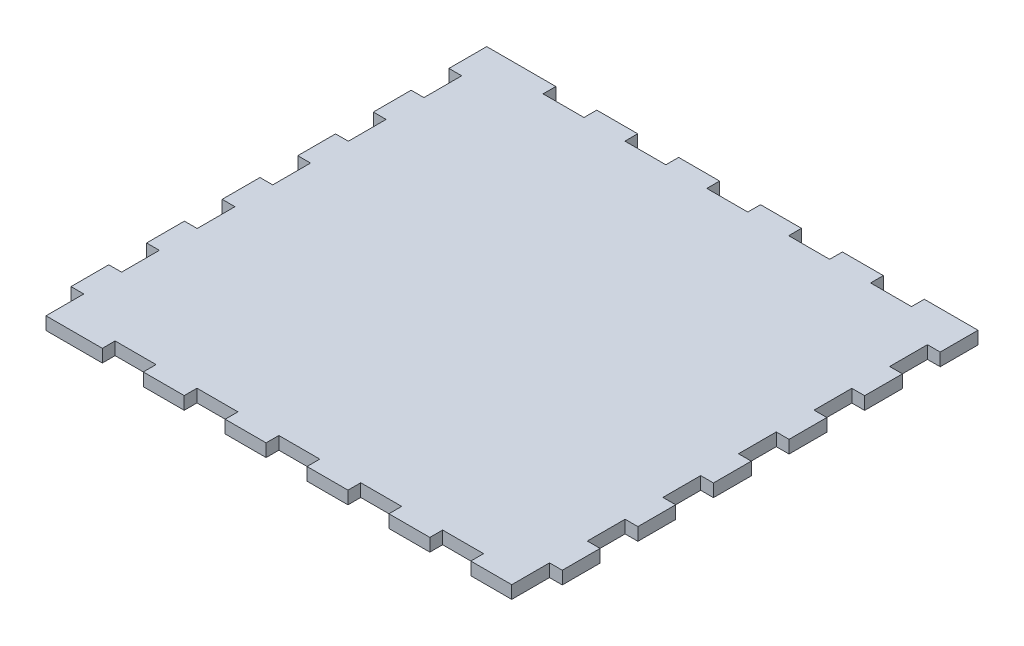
ISO-10303-21;
HEADER;
FILE_DESCRIPTION(('STEP AP214'),'2;1');
FILE_NAME('part.step','',(''),(''),'','','');
FILE_SCHEMA(('AUTOMOTIVE_DESIGN { 1 0 10303 214 1 1 1 1 }'));
ENDSEC;
DATA;
#1=APPLICATION_CONTEXT('core data for automotive mechanical design processes');
#2=APPLICATION_PROTOCOL_DEFINITION('international standard','automotive_design',2000,#1);
#3=PRODUCT_CONTEXT('',#1,'mechanical');
#4=PRODUCT('Part','Part','',(#3));
#5=PRODUCT_RELATED_PRODUCT_CATEGORY('part','',(#4));
#6=PRODUCT_DEFINITION_FORMATION('','',#4);
#7=PRODUCT_DEFINITION_CONTEXT('part definition',#1,'design');
#8=PRODUCT_DEFINITION('design','',#6,#7);
#9=PRODUCT_DEFINITION_SHAPE('','',#8);
#10=(LENGTH_UNIT() NAMED_UNIT(*) SI_UNIT(.MILLI.,.METRE.));
#11=(NAMED_UNIT(*) PLANE_ANGLE_UNIT() SI_UNIT($,.RADIAN.));
#12=(NAMED_UNIT(*) SI_UNIT($,.STERADIAN.) SOLID_ANGLE_UNIT());
#13=UNCERTAINTY_MEASURE_WITH_UNIT(LENGTH_MEASURE(1.E-05),#10,'distance_accuracy_value','');
#14=(GEOMETRIC_REPRESENTATION_CONTEXT(3) GLOBAL_UNCERTAINTY_ASSIGNED_CONTEXT((#13)) GLOBAL_UNIT_ASSIGNED_CONTEXT((#10,
#11,#12)) REPRESENTATION_CONTEXT('',''));
#15=CARTESIAN_POINT('',(0.,0.,0.));
#16=DIRECTION('',(0.,0.,1.));
#17=DIRECTION('',(1.,0.,0.));
#18=AXIS2_PLACEMENT_3D('',#15,#16,#17);
#19=CARTESIAN_POINT('',(-65.,3.38,-60.));
#20=DIRECTION('',(0.,0.,1.));
#21=DIRECTION('',(1.,0.,0.));
#22=AXIS2_PLACEMENT_3D('',#19,#20,#21);
#23=PLANE('',#22);
#24=DIRECTION('',(-1.,0.,0.));
#25=VECTOR('',#24,1.);
#26=CARTESIAN_POINT('',(-65.,0.,-60.));
#27=LINE('',#26,#25);
#28=CARTESIAN_POINT('',(-3.37999999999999,0.,-60.));
#29=VERTEX_POINT('',#28);
#30=CARTESIAN_POINT('',(-14.2133333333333,0.,-60.));
#31=VERTEX_POINT('',#30);
#32=EDGE_CURVE('E600',#29,#31,#27,.T.);
#33=ORIENTED_EDGE('',*,*,#32,.T.);
#34=DIRECTION('',(0.,1.,0.));
#35=VECTOR('',#34,1.);
#36=CARTESIAN_POINT('',(-14.2133333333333,0.,-60.));
#37=LINE('',#36,#35);
#38=CARTESIAN_POINT('',(-14.2133333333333,3.38,-60.));
#39=VERTEX_POINT('',#38);
#40=EDGE_CURVE('E584',#31,#39,#37,.T.);
#41=ORIENTED_EDGE('',*,*,#40,.T.);
#42=DIRECTION('',(-1.,0.,0.));
#43=VECTOR('',#42,1.);
#44=CARTESIAN_POINT('',(-65.,3.38,-60.));
#45=LINE('',#44,#43);
#46=CARTESIAN_POINT('',(-3.37999999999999,3.38,-60.));
#47=VERTEX_POINT('',#46);
#48=EDGE_CURVE('E598',#47,#39,#45,.T.);
#49=ORIENTED_EDGE('',*,*,#48,.F.);
#50=DIRECTION('',(0.,1.,0.));
#51=VECTOR('',#50,1.);
#52=CARTESIAN_POINT('',(-3.37999999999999,0.,-60.));
#53=LINE('',#52,#51);
#54=EDGE_CURVE('E2060',#29,#47,#53,.T.);
#55=ORIENTED_EDGE('',*,*,#54,.F.);
#56=EDGE_LOOP('',(#33,#41,#49,#55));
#57=FACE_BOUND('',#56,.T.);
#58=ADVANCED_FACE('F36',(#57),#23,.F.);
#59=CARTESIAN_POINT('',(18.2866666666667,0.,-60.));
#60=VERTEX_POINT('',#59);
#61=CARTESIAN_POINT('',(7.45333333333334,0.,-60.));
#62=VERTEX_POINT('',#61);
#63=EDGE_CURVE('E2139',#60,#62,#27,.T.);
#64=ORIENTED_EDGE('',*,*,#63,.T.);
#65=DIRECTION('',(0.,1.,0.));
#66=VECTOR('',#65,1.);
#67=CARTESIAN_POINT('',(7.45333333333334,0.,-60.));
#68=LINE('',#67,#66);
#69=CARTESIAN_POINT('',(7.45333333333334,3.38,-60.));
#70=VERTEX_POINT('',#69);
#71=EDGE_CURVE('E2067',#62,#70,#68,.T.);
#72=ORIENTED_EDGE('',*,*,#71,.T.);
#73=CARTESIAN_POINT('',(18.2866666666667,3.38,-60.));
#74=VERTEX_POINT('',#73);
#75=EDGE_CURVE('E607',#74,#70,#45,.T.);
#76=ORIENTED_EDGE('',*,*,#75,.F.);
#77=DIRECTION('',(0.,1.,0.));
#78=VECTOR('',#77,1.);
#79=CARTESIAN_POINT('',(18.2866666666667,0.,-60.));
#80=LINE('',#79,#78);
#81=EDGE_CURVE('E2083',#60,#74,#80,.T.);
#82=ORIENTED_EDGE('',*,*,#81,.F.);
#83=EDGE_LOOP('',(#64,#72,#76,#82));
#84=FACE_BOUND('',#83,.T.);
#85=ADVANCED_FACE('F1120',(#84),#23,.F.);
#86=CARTESIAN_POINT('',(39.9533333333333,0.,-60.));
#87=VERTEX_POINT('',#86);
#88=CARTESIAN_POINT('',(29.12,0.,-60.));
#89=VERTEX_POINT('',#88);
#90=EDGE_CURVE('E638',#87,#89,#27,.T.);
#91=ORIENTED_EDGE('',*,*,#90,.T.);
#92=DIRECTION('',(0.,1.,0.));
#93=VECTOR('',#92,1.);
#94=CARTESIAN_POINT('',(29.12,0.,-60.));
#95=LINE('',#94,#93);
#96=CARTESIAN_POINT('',(29.12,3.38,-60.));
#97=VERTEX_POINT('',#96);
#98=EDGE_CURVE('E2090',#89,#97,#95,.T.);
#99=ORIENTED_EDGE('',*,*,#98,.T.);
#100=CARTESIAN_POINT('',(39.9533333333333,3.38,-60.));
#101=VERTEX_POINT('',#100);
#102=EDGE_CURVE('E611',#101,#97,#45,.T.);
#103=ORIENTED_EDGE('',*,*,#102,.F.);
#104=DIRECTION('',(0.,1.,0.));
#105=VECTOR('',#104,1.);
#106=CARTESIAN_POINT('',(39.9533333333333,0.,-60.));
#107=LINE('',#106,#105);
#108=EDGE_CURVE('E1172',#87,#101,#107,.T.);
#109=ORIENTED_EDGE('',*,*,#108,.F.);
#110=EDGE_LOOP('',(#91,#99,#103,#109));
#111=FACE_BOUND('',#110,.T.);
#112=ADVANCED_FACE('F1124',(#111),#23,.F.);
#113=CARTESIAN_POINT('',(65.,0.,-60.));
#114=VERTEX_POINT('',#113);
#115=CARTESIAN_POINT('',(50.7866666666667,0.,-60.));
#116=VERTEX_POINT('',#115);
#117=EDGE_CURVE('E634',#114,#116,#27,.T.);
#118=ORIENTED_EDGE('',*,*,#117,.T.);
#119=DIRECTION('',(0.,1.,0.));
#120=VECTOR('',#119,1.);
#121=CARTESIAN_POINT('',(50.7866666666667,0.,-60.));
#122=LINE('',#121,#120);
#123=CARTESIAN_POINT('',(50.7866666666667,3.38,-60.));
#124=VERTEX_POINT('',#123);
#125=EDGE_CURVE('E1162',#116,#124,#122,.T.);
#126=ORIENTED_EDGE('',*,*,#125,.T.);
#127=CARTESIAN_POINT('',(65.,3.38,-60.));
#128=VERTEX_POINT('',#127);
#129=EDGE_CURVE('E613',#128,#124,#45,.T.);
#130=ORIENTED_EDGE('',*,*,#129,.F.);
#131=DIRECTION('',(0.,-1.,0.));
#132=VECTOR('',#131,1.);
#133=CARTESIAN_POINT('',(65.,3.38,-60.));
#134=LINE('',#133,#132);
#135=EDGE_CURVE('E12',#128,#114,#134,.T.);
#136=ORIENTED_EDGE('',*,*,#135,.T.);
#137=EDGE_LOOP('',(#118,#126,#130,#136));
#138=FACE_BOUND('',#137,.T.);
#139=ADVANCED_FACE('F1141',(#138),#23,.F.);
#140=CARTESIAN_POINT('',(-65.,3.38,60.));
#141=DIRECTION('',(0.,0.,-1.));
#142=DIRECTION('',(-1.,0.,0.));
#143=AXIS2_PLACEMENT_3D('',#140,#141,#142);
#144=PLANE('',#143);
#145=DIRECTION('',(0.,1.,0.));
#146=VECTOR('',#145,1.);
#147=CARTESIAN_POINT('',(50.7866666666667,0.,60.));
#148=LINE('',#147,#146);
#149=CARTESIAN_POINT('',(50.7866666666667,0.,60.));
#150=VERTEX_POINT('',#149);
#151=CARTESIAN_POINT('',(50.7866666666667,3.38,60.));
#152=VERTEX_POINT('',#151);
#153=EDGE_CURVE('E1192',#150,#152,#148,.T.);
#154=ORIENTED_EDGE('',*,*,#153,.F.);
#155=DIRECTION('',(1.,0.,0.));
#156=VECTOR('',#155,1.);
#157=CARTESIAN_POINT('',(-65.,0.,60.));
#158=LINE('',#157,#156);
#159=CARTESIAN_POINT('',(61.62,0.,60.));
#160=VERTEX_POINT('',#159);
#161=EDGE_CURVE('E644',#150,#160,#158,.T.);
#162=ORIENTED_EDGE('',*,*,#161,.T.);
#163=DIRECTION('',(0.,1.,0.));
#164=VECTOR('',#163,1.);
#165=CARTESIAN_POINT('',(61.62,0.,60.));
#166=LINE('',#165,#164);
#167=CARTESIAN_POINT('',(61.62,3.38,60.));
#168=VERTEX_POINT('',#167);
#169=EDGE_CURVE('E797',#160,#168,#166,.T.);
#170=ORIENTED_EDGE('',*,*,#169,.T.);
#171=DIRECTION('',(1.,0.,0.));
#172=VECTOR('',#171,1.);
#173=CARTESIAN_POINT('',(-65.,3.38,60.));
#174=LINE('',#173,#172);
#175=EDGE_CURVE('E623',#152,#168,#174,.T.);
#176=ORIENTED_EDGE('',*,*,#175,.F.);
#177=EDGE_LOOP('',(#154,#162,#170,#176));
#178=FACE_BOUND('',#177,.T.);
#179=ADVANCED_FACE('F1149',(#178),#144,.F.);
#180=DIRECTION('',(0.,1.,0.));
#181=VECTOR('',#180,1.);
#182=CARTESIAN_POINT('',(39.9533333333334,0.,60.));
#183=LINE('',#182,#181);
#184=CARTESIAN_POINT('',(39.9533333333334,0.,60.));
#185=VERTEX_POINT('',#184);
#186=CARTESIAN_POINT('',(39.9533333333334,3.38,60.));
#187=VERTEX_POINT('',#186);
#188=EDGE_CURVE('E1189',#185,#187,#183,.T.);
#189=ORIENTED_EDGE('',*,*,#188,.T.);
#190=CARTESIAN_POINT('',(29.12,3.38,60.));
#191=VERTEX_POINT('',#190);
#192=EDGE_CURVE('E2149',#191,#187,#174,.T.);
#193=ORIENTED_EDGE('',*,*,#192,.F.);
#194=DIRECTION('',(0.,1.,0.));
#195=VECTOR('',#194,1.);
#196=CARTESIAN_POINT('',(29.12,0.,60.));
#197=LINE('',#196,#195);
#198=CARTESIAN_POINT('',(29.12,0.,60.));
#199=VERTEX_POINT('',#198);
#200=EDGE_CURVE('E1218',#199,#191,#197,.T.);
#201=ORIENTED_EDGE('',*,*,#200,.F.);
#202=EDGE_CURVE('E2154',#199,#185,#158,.T.);
#203=ORIENTED_EDGE('',*,*,#202,.T.);
#204=EDGE_LOOP('',(#189,#193,#201,#203));
#205=FACE_BOUND('',#204,.T.);
#206=ADVANCED_FACE('F1155',(#205),#144,.F.);
#207=DIRECTION('',(0.,1.,0.));
#208=VECTOR('',#207,1.);
#209=CARTESIAN_POINT('',(18.2866666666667,0.,60.));
#210=LINE('',#209,#208);
#211=CARTESIAN_POINT('',(18.2866666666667,0.,60.));
#212=VERTEX_POINT('',#211);
#213=CARTESIAN_POINT('',(18.2866666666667,3.38,60.));
#214=VERTEX_POINT('',#213);
#215=EDGE_CURVE('E1215',#212,#214,#210,.T.);
#216=ORIENTED_EDGE('',*,*,#215,.T.);
#217=CARTESIAN_POINT('',(7.45333333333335,3.38,60.));
#218=VERTEX_POINT('',#217);
#219=EDGE_CURVE('E2169',#218,#214,#174,.T.);
#220=ORIENTED_EDGE('',*,*,#219,.F.);
#221=DIRECTION('',(0.,1.,0.));
#222=VECTOR('',#221,1.);
#223=CARTESIAN_POINT('',(7.45333333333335,0.,60.));
#224=LINE('',#223,#222);
#225=CARTESIAN_POINT('',(7.45333333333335,0.,60.));
#226=VERTEX_POINT('',#225);
#227=EDGE_CURVE('E1243',#226,#218,#224,.T.);
#228=ORIENTED_EDGE('',*,*,#227,.F.);
#229=EDGE_CURVE('E2156',#226,#212,#158,.T.);
#230=ORIENTED_EDGE('',*,*,#229,.T.);
#231=EDGE_LOOP('',(#216,#220,#228,#230));
#232=FACE_BOUND('',#231,.T.);
#233=ADVANCED_FACE('F1738',(#232),#144,.F.);
#234=DIRECTION('',(0.,1.,0.));
#235=VECTOR('',#234,1.);
#236=CARTESIAN_POINT('',(-3.37999999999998,0.,60.));
#237=LINE('',#236,#235);
#238=CARTESIAN_POINT('',(-3.37999999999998,0.,60.));
#239=VERTEX_POINT('',#238);
#240=CARTESIAN_POINT('',(-3.37999999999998,3.38,60.));
#241=VERTEX_POINT('',#240);
#242=EDGE_CURVE('E1240',#239,#241,#237,.T.);
#243=ORIENTED_EDGE('',*,*,#242,.T.);
#244=CARTESIAN_POINT('',(-14.2133333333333,3.38,60.));
#245=VERTEX_POINT('',#244);
#246=EDGE_CURVE('E2171',#245,#241,#174,.T.);
#247=ORIENTED_EDGE('',*,*,#246,.F.);
#248=DIRECTION('',(0.,1.,0.));
#249=VECTOR('',#248,1.);
#250=CARTESIAN_POINT('',(-14.2133333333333,0.,60.));
#251=LINE('',#250,#249);
#252=CARTESIAN_POINT('',(-14.2133333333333,0.,60.));
#253=VERTEX_POINT('',#252);
#254=EDGE_CURVE('E1268',#253,#245,#251,.T.);
#255=ORIENTED_EDGE('',*,*,#254,.F.);
#256=EDGE_CURVE('E2158',#253,#239,#158,.T.);
#257=ORIENTED_EDGE('',*,*,#256,.T.);
#258=EDGE_LOOP('',(#243,#247,#255,#257));
#259=FACE_BOUND('',#258,.T.);
#260=ADVANCED_FACE('F1730',(#259),#144,.F.);
#261=DIRECTION('',(0.,1.,0.));
#262=VECTOR('',#261,1.);
#263=CARTESIAN_POINT('',(-25.0466666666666,0.,60.));
#264=LINE('',#263,#262);
#265=CARTESIAN_POINT('',(-25.0466666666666,0.,60.));
#266=VERTEX_POINT('',#265);
#267=CARTESIAN_POINT('',(-25.0466666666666,3.38,60.));
#268=VERTEX_POINT('',#267);
#269=EDGE_CURVE('E1265',#266,#268,#264,.T.);
#270=ORIENTED_EDGE('',*,*,#269,.T.);
#271=CARTESIAN_POINT('',(-35.88,3.38,60.));
#272=VERTEX_POINT('',#271);
#273=EDGE_CURVE('E628',#272,#268,#174,.T.);
#274=ORIENTED_EDGE('',*,*,#273,.F.);
#275=DIRECTION('',(0.,1.,0.));
#276=VECTOR('',#275,1.);
#277=CARTESIAN_POINT('',(-35.88,0.,60.));
#278=LINE('',#277,#276);
#279=CARTESIAN_POINT('',(-35.88,0.,60.));
#280=VERTEX_POINT('',#279);
#281=EDGE_CURVE('E1293',#280,#272,#278,.T.);
#282=ORIENTED_EDGE('',*,*,#281,.F.);
#283=EDGE_CURVE('E649',#280,#266,#158,.T.);
#284=ORIENTED_EDGE('',*,*,#283,.T.);
#285=EDGE_LOOP('',(#270,#274,#282,#284));
#286=FACE_BOUND('',#285,.T.);
#287=ADVANCED_FACE('F1722',(#286),#144,.F.);
#288=DIRECTION('',(0.,1.,0.));
#289=VECTOR('',#288,1.);
#290=CARTESIAN_POINT('',(-46.7133333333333,0.,60.));
#291=LINE('',#290,#289);
#292=CARTESIAN_POINT('',(-46.7133333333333,0.,60.));
#293=VERTEX_POINT('',#292);
#294=CARTESIAN_POINT('',(-46.7133333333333,3.38,60.));
#295=VERTEX_POINT('',#294);
#296=EDGE_CURVE('E1290',#293,#295,#291,.T.);
#297=ORIENTED_EDGE('',*,*,#296,.T.);
#298=CARTESIAN_POINT('',(-61.62,3.38,60.));
#299=VERTEX_POINT('',#298);
#300=EDGE_CURVE('E625',#299,#295,#174,.T.);
#301=ORIENTED_EDGE('',*,*,#300,.F.);
#302=DIRECTION('',(0.,1.,0.));
#303=VECTOR('',#302,1.);
#304=CARTESIAN_POINT('',(-61.62,0.,60.));
#305=LINE('',#304,#303);
#306=CARTESIAN_POINT('',(-61.62,0.,60.));
#307=VERTEX_POINT('',#306);
#308=EDGE_CURVE('E844',#307,#299,#305,.T.);
#309=ORIENTED_EDGE('',*,*,#308,.F.);
#310=EDGE_CURVE('E646',#307,#293,#158,.T.);
#311=ORIENTED_EDGE('',*,*,#310,.T.);
#312=EDGE_LOOP('',(#297,#301,#309,#311));
#313=FACE_BOUND('',#312,.T.);
#314=ADVANCED_FACE('F1158',(#313),#144,.F.);
#315=CARTESIAN_POINT('',(0.,3.38,0.));
#316=DIRECTION('',(0.,1.,0.));
#317=DIRECTION('',(0.,0.,1.));
#318=AXIS2_PLACEMENT_3D('',#315,#316,#317);
#319=PLANE('',#318);
#320=DIRECTION('',(0.,0.,-1.));
#321=VECTOR('',#320,1.);
#322=CARTESIAN_POINT('',(-14.2133333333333,3.38,0.));
#323=LINE('',#322,#321);
#324=CARTESIAN_POINT('',(-14.2133333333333,3.38,-56.62));
#325=VERTEX_POINT('',#324);
#326=EDGE_CURVE('E580',#325,#39,#323,.T.);
#327=ORIENTED_EDGE('',*,*,#326,.F.);
#328=DIRECTION('',(1.,0.,0.));
#329=VECTOR('',#328,1.);
#330=CARTESIAN_POINT('',(0.,3.38,-56.62));
#331=LINE('',#330,#329);
#332=CARTESIAN_POINT('',(-25.0466666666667,3.38,-56.6199999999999));
#333=VERTEX_POINT('',#332);
#334=EDGE_CURVE('E591',#333,#325,#331,.T.);
#335=ORIENTED_EDGE('',*,*,#334,.F.);
#336=DIRECTION('',(0.,0.,1.));
#337=VECTOR('',#336,1.);
#338=CARTESIAN_POINT('',(-25.0466666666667,3.38,0.));
#339=LINE('',#338,#337);
#340=CARTESIAN_POINT('',(-25.0466666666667,3.38,-60.));
#341=VERTEX_POINT('',#340);
#342=EDGE_CURVE('E1316',#341,#333,#339,.T.);
#343=ORIENTED_EDGE('',*,*,#342,.F.);
#344=CARTESIAN_POINT('',(-35.88,3.38,-60.));
#345=VERTEX_POINT('',#344);
#346=EDGE_CURVE('E608',#341,#345,#45,.T.);
#347=ORIENTED_EDGE('',*,*,#346,.T.);
#348=DIRECTION('',(0.,0.,-1.));
#349=VECTOR('',#348,1.);
#350=CARTESIAN_POINT('',(-35.88,3.38,0.));
#351=LINE('',#350,#349);
#352=CARTESIAN_POINT('',(-35.88,3.38,-56.6199999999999));
#353=VERTEX_POINT('',#352);
#354=EDGE_CURVE('E1311',#353,#345,#351,.T.);
#355=ORIENTED_EDGE('',*,*,#354,.F.);
#356=DIRECTION('',(1.,0.,0.));
#357=VECTOR('',#356,1.);
#358=CARTESIAN_POINT('',(0.,3.38,-56.6199999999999));
#359=LINE('',#358,#357);
#360=CARTESIAN_POINT('',(-46.7133333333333,3.38,-56.6199999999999));
#361=VERTEX_POINT('',#360);
#362=EDGE_CURVE('E1315',#361,#353,#359,.T.);
#363=ORIENTED_EDGE('',*,*,#362,.F.);
#364=DIRECTION('',(0.,0.,1.));
#365=VECTOR('',#364,1.);
#366=CARTESIAN_POINT('',(-46.7133333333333,3.38,0.));
#367=LINE('',#366,#365);
#368=CARTESIAN_POINT('',(-46.7133333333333,3.38,-60.));
#369=VERTEX_POINT('',#368);
#370=EDGE_CURVE('E1034',#369,#361,#367,.T.);
#371=ORIENTED_EDGE('',*,*,#370,.F.);
#372=CARTESIAN_POINT('',(-65.,3.38,-60.));
#373=VERTEX_POINT('',#372);
#374=EDGE_CURVE('E612',#369,#373,#45,.T.);
#375=ORIENTED_EDGE('',*,*,#374,.T.);
#376=DIRECTION('',(0.,0.,1.));
#377=VECTOR('',#376,1.);
#378=CARTESIAN_POINT('',(-65.,3.38,-60.));
#379=LINE('',#378,#377);
#380=CARTESIAN_POINT('',(-65.,3.38,-50.));
#381=VERTEX_POINT('',#380);
#382=EDGE_CURVE('E620',#373,#381,#379,.T.);
#383=ORIENTED_EDGE('',*,*,#382,.T.);
#384=DIRECTION('',(1.,0.,0.));
#385=VECTOR('',#384,1.);
#386=CARTESIAN_POINT('',(0.,3.38,-50.));
#387=LINE('',#386,#385);
#388=CARTESIAN_POINT('',(-61.62,3.38,-50.));
#389=VERTEX_POINT('',#388);
#390=EDGE_CURVE('E685',#381,#389,#387,.T.);
#391=ORIENTED_EDGE('',*,*,#390,.T.);
#392=DIRECTION('',(0.,0.,1.));
#393=VECTOR('',#392,1.);
#394=CARTESIAN_POINT('',(-61.62,3.38,0.));
#395=LINE('',#394,#393);
#396=CARTESIAN_POINT('',(-61.62,3.38,-40.));
#397=VERTEX_POINT('',#396);
#398=EDGE_CURVE('E681',#389,#397,#395,.T.);
#399=ORIENTED_EDGE('',*,*,#398,.T.);
#400=DIRECTION('',(-1.,0.,0.));
#401=VECTOR('',#400,1.);
#402=CARTESIAN_POINT('',(0.,3.38,-40.));
#403=LINE('',#402,#401);
#404=CARTESIAN_POINT('',(-65.,3.38,-40.));
#405=VERTEX_POINT('',#404);
#406=EDGE_CURVE('E678',#397,#405,#403,.T.);
#407=ORIENTED_EDGE('',*,*,#406,.T.);
#408=CARTESIAN_POINT('',(-65.,3.38,-30.));
#409=VERTEX_POINT('',#408);
#410=EDGE_CURVE('E624',#405,#409,#379,.T.);
#411=ORIENTED_EDGE('',*,*,#410,.T.);
#412=DIRECTION('',(1.,0.,0.));
#413=VECTOR('',#412,1.);
#414=CARTESIAN_POINT('',(0.,3.38,-30.));
#415=LINE('',#414,#413);
#416=CARTESIAN_POINT('',(-61.62,3.38,-30.));
#417=VERTEX_POINT('',#416);
#418=EDGE_CURVE('E950',#409,#417,#415,.T.);
#419=ORIENTED_EDGE('',*,*,#418,.T.);
#420=DIRECTION('',(0.,0.,1.));
#421=VECTOR('',#420,1.);
#422=CARTESIAN_POINT('',(-61.62,3.38,0.));
#423=LINE('',#422,#421);
#424=CARTESIAN_POINT('',(-61.62,3.38,-20.));
#425=VERTEX_POINT('',#424);
#426=EDGE_CURVE('E958',#417,#425,#423,.T.);
#427=ORIENTED_EDGE('',*,*,#426,.T.);
#428=DIRECTION('',(-1.,0.,0.));
#429=VECTOR('',#428,1.);
#430=CARTESIAN_POINT('',(0.,3.38,-20.));
#431=LINE('',#430,#429);
#432=CARTESIAN_POINT('',(-65.,3.38,-20.));
#433=VERTEX_POINT('',#432);
#434=EDGE_CURVE('E690',#425,#433,#431,.T.);
#435=ORIENTED_EDGE('',*,*,#434,.T.);
#436=CARTESIAN_POINT('',(-65.,3.38,-10.));
#437=VERTEX_POINT('',#436);
#438=EDGE_CURVE('E1023',#433,#437,#379,.T.);
#439=ORIENTED_EDGE('',*,*,#438,.T.);
#440=DIRECTION('',(1.,0.,0.));
#441=VECTOR('',#440,1.);
#442=CARTESIAN_POINT('',(0.,3.38,-10.));
#443=LINE('',#442,#441);
#444=CARTESIAN_POINT('',(-61.62,3.38,-10.));
#445=VERTEX_POINT('',#444);
#446=EDGE_CURVE('E925',#437,#445,#443,.T.);
#447=ORIENTED_EDGE('',*,*,#446,.T.);
#448=DIRECTION('',(0.,0.,1.));
#449=VECTOR('',#448,1.);
#450=CARTESIAN_POINT('',(-61.62,3.38,0.));
#451=LINE('',#450,#449);
#452=CARTESIAN_POINT('',(-61.62,3.38,0.));
#453=VERTEX_POINT('',#452);
#454=EDGE_CURVE('E934',#445,#453,#451,.T.);
#455=ORIENTED_EDGE('',*,*,#454,.T.);
#456=DIRECTION('',(-1.,0.,0.));
#457=VECTOR('',#456,1.);
#458=CARTESIAN_POINT('',(0.,3.38,0.));
#459=LINE('',#458,#457);
#460=CARTESIAN_POINT('',(-65.,3.38,0.));
#461=VERTEX_POINT('',#460);
#462=EDGE_CURVE('E931',#453,#461,#459,.T.);
#463=ORIENTED_EDGE('',*,*,#462,.T.);
#464=CARTESIAN_POINT('',(-65.,3.38,9.99999999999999));
#465=VERTEX_POINT('',#464);
#466=EDGE_CURVE('E1020',#461,#465,#379,.T.);
#467=ORIENTED_EDGE('',*,*,#466,.T.);
#468=DIRECTION('',(1.,0.,0.));
#469=VECTOR('',#468,1.);
#470=CARTESIAN_POINT('',(0.,3.38,9.99999999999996));
#471=LINE('',#470,#469);
#472=CARTESIAN_POINT('',(-61.62,3.38,9.99999999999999));
#473=VERTEX_POINT('',#472);
#474=EDGE_CURVE('E900',#465,#473,#471,.T.);
#475=ORIENTED_EDGE('',*,*,#474,.T.);
#476=DIRECTION('',(0.,0.,1.));
#477=VECTOR('',#476,1.);
#478=CARTESIAN_POINT('',(-61.62,3.38,0.));
#479=LINE('',#478,#477);
#480=CARTESIAN_POINT('',(-61.62,3.38,20.));
#481=VERTEX_POINT('',#480);
#482=EDGE_CURVE('E909',#473,#481,#479,.T.);
#483=ORIENTED_EDGE('',*,*,#482,.T.);
#484=DIRECTION('',(-1.,0.,0.));
#485=VECTOR('',#484,1.);
#486=CARTESIAN_POINT('',(0.,3.38,20.));
#487=LINE('',#486,#485);
#488=CARTESIAN_POINT('',(-65.,3.38,20.));
#489=VERTEX_POINT('',#488);
#490=EDGE_CURVE('E906',#481,#489,#487,.T.);
#491=ORIENTED_EDGE('',*,*,#490,.T.);
#492=CARTESIAN_POINT('',(-65.,3.38,30.));
#493=VERTEX_POINT('',#492);
#494=EDGE_CURVE('E1018',#489,#493,#379,.T.);
#495=ORIENTED_EDGE('',*,*,#494,.T.);
#496=DIRECTION('',(1.,0.,0.));
#497=VECTOR('',#496,1.);
#498=CARTESIAN_POINT('',(0.,3.38,30.));
#499=LINE('',#498,#497);
#500=CARTESIAN_POINT('',(-61.62,3.38,30.));
#501=VERTEX_POINT('',#500);
#502=EDGE_CURVE('E875',#493,#501,#499,.T.);
#503=ORIENTED_EDGE('',*,*,#502,.T.);
#504=DIRECTION('',(0.,0.,1.));
#505=VECTOR('',#504,1.);
#506=CARTESIAN_POINT('',(-61.62,3.38,0.));
#507=LINE('',#506,#505);
#508=CARTESIAN_POINT('',(-61.62,3.38,40.));
#509=VERTEX_POINT('',#508);
#510=EDGE_CURVE('E884',#501,#509,#507,.T.);
#511=ORIENTED_EDGE('',*,*,#510,.T.);
#512=DIRECTION('',(-1.,0.,0.));
#513=VECTOR('',#512,1.);
#514=CARTESIAN_POINT('',(0.,3.38,40.));
#515=LINE('',#514,#513);
#516=CARTESIAN_POINT('',(-65.,3.38,40.));
#517=VERTEX_POINT('',#516);
#518=EDGE_CURVE('E881',#509,#517,#515,.T.);
#519=ORIENTED_EDGE('',*,*,#518,.T.);
#520=CARTESIAN_POINT('',(-65.,3.38,50.));
#521=VERTEX_POINT('',#520);
#522=EDGE_CURVE('E617',#517,#521,#379,.T.);
#523=ORIENTED_EDGE('',*,*,#522,.T.);
#524=DIRECTION('',(1.,0.,0.));
#525=VECTOR('',#524,1.);
#526=CARTESIAN_POINT('',(0.,3.38,50.));
#527=LINE('',#526,#525);
#528=CARTESIAN_POINT('',(-61.62,3.38,50.));
#529=VERTEX_POINT('',#528);
#530=EDGE_CURVE('E858',#521,#529,#527,.T.);
#531=ORIENTED_EDGE('',*,*,#530,.T.);
#532=DIRECTION('',(0.,0.,1.));
#533=VECTOR('',#532,1.);
#534=CARTESIAN_POINT('',(-61.62,3.38,0.));
#535=LINE('',#534,#533);
#536=EDGE_CURVE('E861',#529,#299,#535,.T.);
#537=ORIENTED_EDGE('',*,*,#536,.T.);
#538=ORIENTED_EDGE('',*,*,#300,.T.);
#539=DIRECTION('',(0.,0.,-1.));
#540=VECTOR('',#539,1.);
#541=CARTESIAN_POINT('',(-46.7133333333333,3.38,0.));
#542=LINE('',#541,#540);
#543=CARTESIAN_POINT('',(-46.7133333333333,3.38,56.62));
#544=VERTEX_POINT('',#543);
#545=EDGE_CURVE('E1295',#295,#544,#542,.T.);
#546=ORIENTED_EDGE('',*,*,#545,.T.);
#547=DIRECTION('',(1.,0.,0.));
#548=VECTOR('',#547,1.);
#549=CARTESIAN_POINT('',(0.,3.38,56.62));
#550=LINE('',#549,#548);
#551=CARTESIAN_POINT('',(-35.88,3.38,56.62));
#552=VERTEX_POINT('',#551);
#553=EDGE_CURVE('E1298',#544,#552,#550,.T.);
#554=ORIENTED_EDGE('',*,*,#553,.T.);
#555=DIRECTION('',(0.,0.,1.));
#556=VECTOR('',#555,1.);
#557=CARTESIAN_POINT('',(-35.88,3.38,0.));
#558=LINE('',#557,#556);
#559=EDGE_CURVE('E1270',#552,#272,#558,.T.);
#560=ORIENTED_EDGE('',*,*,#559,.T.);
#561=ORIENTED_EDGE('',*,*,#273,.T.);
#562=DIRECTION('',(0.,0.,-1.));
#563=VECTOR('',#562,1.);
#564=CARTESIAN_POINT('',(-25.0466666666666,3.38,0.));
#565=LINE('',#564,#563);
#566=CARTESIAN_POINT('',(-25.0466666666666,3.38,56.62));
#567=VERTEX_POINT('',#566);
#568=EDGE_CURVE('E1271',#268,#567,#565,.T.);
#569=ORIENTED_EDGE('',*,*,#568,.T.);
#570=DIRECTION('',(1.,0.,0.));
#571=VECTOR('',#570,1.);
#572=CARTESIAN_POINT('',(0.,3.38,56.62));
#573=LINE('',#572,#571);
#574=CARTESIAN_POINT('',(-14.2133333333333,3.38,56.62));
#575=VERTEX_POINT('',#574);
#576=EDGE_CURVE('E1274',#567,#575,#573,.T.);
#577=ORIENTED_EDGE('',*,*,#576,.T.);
#578=DIRECTION('',(0.,0.,1.));
#579=VECTOR('',#578,1.);
#580=CARTESIAN_POINT('',(-14.2133333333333,3.38,0.));
#581=LINE('',#580,#579);
#582=EDGE_CURVE('E1245',#575,#245,#581,.T.);
#583=ORIENTED_EDGE('',*,*,#582,.T.);
#584=ORIENTED_EDGE('',*,*,#246,.T.);
#585=DIRECTION('',(0.,0.,-1.));
#586=VECTOR('',#585,1.);
#587=CARTESIAN_POINT('',(-3.37999999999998,3.38,0.));
#588=LINE('',#587,#586);
#589=CARTESIAN_POINT('',(-3.37999999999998,3.38,56.62));
#590=VERTEX_POINT('',#589);
#591=EDGE_CURVE('E1246',#241,#590,#588,.T.);
#592=ORIENTED_EDGE('',*,*,#591,.T.);
#593=DIRECTION('',(1.,0.,0.));
#594=VECTOR('',#593,1.);
#595=CARTESIAN_POINT('',(0.,3.38,56.62));
#596=LINE('',#595,#594);
#597=CARTESIAN_POINT('',(7.45333333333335,3.38,56.62));
#598=VERTEX_POINT('',#597);
#599=EDGE_CURVE('E1249',#590,#598,#596,.T.);
#600=ORIENTED_EDGE('',*,*,#599,.T.);
#601=DIRECTION('',(0.,0.,1.));
#602=VECTOR('',#601,1.);
#603=CARTESIAN_POINT('',(7.45333333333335,3.38,0.));
#604=LINE('',#603,#602);
#605=EDGE_CURVE('E1220',#598,#218,#604,.T.);
#606=ORIENTED_EDGE('',*,*,#605,.T.);
#607=ORIENTED_EDGE('',*,*,#219,.T.);
#608=DIRECTION('',(0.,0.,-1.));
#609=VECTOR('',#608,1.);
#610=CARTESIAN_POINT('',(18.2866666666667,3.38,0.));
#611=LINE('',#610,#609);
#612=CARTESIAN_POINT('',(18.2866666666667,3.38,56.62));
#613=VERTEX_POINT('',#612);
#614=EDGE_CURVE('E1221',#214,#613,#611,.T.);
#615=ORIENTED_EDGE('',*,*,#614,.T.);
#616=DIRECTION('',(1.,0.,0.));
#617=VECTOR('',#616,1.);
#618=CARTESIAN_POINT('',(0.,3.38,56.62));
#619=LINE('',#618,#617);
#620=CARTESIAN_POINT('',(29.12,3.38,56.62));
#621=VERTEX_POINT('',#620);
#622=EDGE_CURVE('E1224',#613,#621,#619,.T.);
#623=ORIENTED_EDGE('',*,*,#622,.T.);
#624=DIRECTION('',(0.,0.,1.));
#625=VECTOR('',#624,1.);
#626=CARTESIAN_POINT('',(29.12,3.38,0.));
#627=LINE('',#626,#625);
#628=EDGE_CURVE('E1194',#621,#191,#627,.T.);
#629=ORIENTED_EDGE('',*,*,#628,.T.);
#630=ORIENTED_EDGE('',*,*,#192,.T.);
#631=DIRECTION('',(0.,0.,-1.));
#632=VECTOR('',#631,1.);
#633=CARTESIAN_POINT('',(39.9533333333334,3.38,0.));
#634=LINE('',#633,#632);
#635=CARTESIAN_POINT('',(39.9533333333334,3.38,56.62));
#636=VERTEX_POINT('',#635);
#637=EDGE_CURVE('E1195',#187,#636,#634,.T.);
#638=ORIENTED_EDGE('',*,*,#637,.T.);
#639=DIRECTION('',(1.,0.,0.));
#640=VECTOR('',#639,1.);
#641=CARTESIAN_POINT('',(0.,3.38,56.62));
#642=LINE('',#641,#640);
#643=CARTESIAN_POINT('',(50.7866666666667,3.38,56.62));
#644=VERTEX_POINT('',#643);
#645=EDGE_CURVE('E1198',#636,#644,#642,.T.);
#646=ORIENTED_EDGE('',*,*,#645,.T.);
#647=DIRECTION('',(0.,0.,1.));
#648=VECTOR('',#647,1.);
#649=CARTESIAN_POINT('',(50.7866666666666,3.38,-1.04261328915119E-13));
#650=LINE('',#649,#648);
#651=EDGE_CURVE('E1202',#644,#152,#650,.T.);
#652=ORIENTED_EDGE('',*,*,#651,.T.);
#653=ORIENTED_EDGE('',*,*,#175,.T.);
#654=DIRECTION('',(0.,0.,1.));
#655=VECTOR('',#654,1.);
#656=CARTESIAN_POINT('',(61.62,3.38,0.));
#657=LINE('',#656,#655);
#658=CARTESIAN_POINT('',(61.62,3.38,50.));
#659=VERTEX_POINT('',#658);
#660=EDGE_CURVE('E814',#659,#168,#657,.T.);
#661=ORIENTED_EDGE('',*,*,#660,.F.);
#662=DIRECTION('',(-1.,0.,0.));
#663=VECTOR('',#662,1.);
#664=CARTESIAN_POINT('',(2.05292719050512E-13,3.38,50.0000000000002));
#665=LINE('',#664,#663);
#666=CARTESIAN_POINT('',(65.,3.38,50.));
#667=VERTEX_POINT('',#666);
#668=EDGE_CURVE('E818',#667,#659,#665,.T.);
#669=ORIENTED_EDGE('',*,*,#668,.F.);
#670=DIRECTION('',(0.,0.,-1.));
#671=VECTOR('',#670,1.);
#672=CARTESIAN_POINT('',(65.,3.38,-60.));
#673=LINE('',#672,#671);
#674=CARTESIAN_POINT('',(65.,3.38,40.));
#675=VERTEX_POINT('',#674);
#676=EDGE_CURVE('E736',#667,#675,#673,.T.);
#677=ORIENTED_EDGE('',*,*,#676,.T.);
#678=DIRECTION('',(1.,0.,0.));
#679=VECTOR('',#678,1.);
#680=CARTESIAN_POINT('',(1.6423417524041E-13,3.38,40.0000000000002));
#681=LINE('',#680,#679);
#682=CARTESIAN_POINT('',(61.62,3.38,40.));
#683=VERTEX_POINT('',#682);
#684=EDGE_CURVE('E833',#683,#675,#681,.T.);
#685=ORIENTED_EDGE('',*,*,#684,.F.);
#686=DIRECTION('',(0.,0.,1.));
#687=VECTOR('',#686,1.);
#688=CARTESIAN_POINT('',(61.62,3.38,0.));
#689=LINE('',#688,#687);
#690=CARTESIAN_POINT('',(61.62,3.38,30.));
#691=VERTEX_POINT('',#690);
#692=EDGE_CURVE('E843',#691,#683,#689,.T.);
#693=ORIENTED_EDGE('',*,*,#692,.F.);
#694=DIRECTION('',(-1.,0.,0.));
#695=VECTOR('',#694,1.);
#696=CARTESIAN_POINT('',(1.23175631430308E-13,3.38,30.0000000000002));
#697=LINE('',#696,#695);
#698=CARTESIAN_POINT('',(65.,3.38,30.));
#699=VERTEX_POINT('',#698);
#700=EDGE_CURVE('E840',#699,#691,#697,.T.);
#701=ORIENTED_EDGE('',*,*,#700,.F.);
#702=CARTESIAN_POINT('',(65.,3.38,20.));
#703=VERTEX_POINT('',#702);
#704=EDGE_CURVE('E741',#699,#703,#673,.T.);
#705=ORIENTED_EDGE('',*,*,#704,.T.);
#706=DIRECTION('',(1.,0.,0.));
#707=VECTOR('',#706,1.);
#708=CARTESIAN_POINT('',(0.,3.38,20.0000000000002));
#709=LINE('',#708,#707);
#710=CARTESIAN_POINT('',(61.62,3.38,20.));
#711=VERTEX_POINT('',#710);
#712=EDGE_CURVE('E789',#711,#703,#709,.T.);
#713=ORIENTED_EDGE('',*,*,#712,.F.);
#714=DIRECTION('',(0.,0.,1.));
#715=VECTOR('',#714,1.);
#716=CARTESIAN_POINT('',(61.62,3.38,0.));
#717=LINE('',#716,#715);
#718=CARTESIAN_POINT('',(61.62,3.38,9.99999999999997));
#719=VERTEX_POINT('',#718);
#720=EDGE_CURVE('E796',#719,#711,#717,.T.);
#721=ORIENTED_EDGE('',*,*,#720,.F.);
#722=DIRECTION('',(-1.,0.,0.));
#723=VECTOR('',#722,1.);
#724=CARTESIAN_POINT('',(0.,3.38,10.0000000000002));
#725=LINE('',#724,#723);
#726=CARTESIAN_POINT('',(65.,3.38,9.99999999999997));
#727=VERTEX_POINT('',#726);
#728=EDGE_CURVE('E757',#727,#719,#725,.T.);
#729=ORIENTED_EDGE('',*,*,#728,.F.);
#730=CARTESIAN_POINT('',(65.,3.38,0.));
#731=VERTEX_POINT('',#730);
#732=EDGE_CURVE('E735',#727,#731,#673,.T.);
#733=ORIENTED_EDGE('',*,*,#732,.T.);
#734=DIRECTION('',(1.,0.,0.));
#735=VECTOR('',#734,1.);
#736=CARTESIAN_POINT('',(0.,3.38,0.));
#737=LINE('',#736,#735);
#738=CARTESIAN_POINT('',(61.62,3.38,0.));
#739=VERTEX_POINT('',#738);
#740=EDGE_CURVE('E754',#739,#731,#737,.T.);
#741=ORIENTED_EDGE('',*,*,#740,.F.);
#742=DIRECTION('',(0.,0.,1.));
#743=VECTOR('',#742,1.);
#744=CARTESIAN_POINT('',(61.62,3.38,0.));
#745=LINE('',#744,#743);
#746=CARTESIAN_POINT('',(61.62,3.38,-10.));
#747=VERTEX_POINT('',#746);
#748=EDGE_CURVE('E1077',#747,#739,#745,.T.);
#749=ORIENTED_EDGE('',*,*,#748,.F.);
#750=DIRECTION('',(-1.,0.,0.));
#751=VECTOR('',#750,1.);
#752=CARTESIAN_POINT('',(0.,3.38,-10.0000000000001));
#753=LINE('',#752,#751);
#754=CARTESIAN_POINT('',(65.,3.38,-10.));
#755=VERTEX_POINT('',#754);
#756=EDGE_CURVE('E804',#755,#747,#753,.T.);
#757=ORIENTED_EDGE('',*,*,#756,.F.);
#758=CARTESIAN_POINT('',(65.,3.38,-20.));
#759=VERTEX_POINT('',#758);
#760=EDGE_CURVE('E618',#755,#759,#673,.T.);
#761=ORIENTED_EDGE('',*,*,#760,.T.);
#762=DIRECTION('',(1.,0.,0.));
#763=VECTOR('',#762,1.);
#764=CARTESIAN_POINT('',(0.,3.38,-20.));
#765=LINE('',#764,#763);
#766=CARTESIAN_POINT('',(61.62,3.38,-20.));
#767=VERTEX_POINT('',#766);
#768=EDGE_CURVE('E698',#767,#759,#765,.T.);
#769=ORIENTED_EDGE('',*,*,#768,.F.);
#770=DIRECTION('',(0.,0.,1.));
#771=VECTOR('',#770,1.);
#772=CARTESIAN_POINT('',(61.62,3.38,0.));
#773=LINE('',#772,#771);
#774=CARTESIAN_POINT('',(61.62,3.38,-30.));
#775=VERTEX_POINT('',#774);
#776=EDGE_CURVE('E708',#775,#767,#773,.T.);
#777=ORIENTED_EDGE('',*,*,#776,.F.);
#778=DIRECTION('',(-1.,0.,0.));
#779=VECTOR('',#778,1.);
#780=CARTESIAN_POINT('',(0.,3.38,-30.));
#781=LINE('',#780,#779);
#782=CARTESIAN_POINT('',(65.,3.38,-30.));
#783=VERTEX_POINT('',#782);
#784=EDGE_CURVE('E705',#783,#775,#781,.T.);
#785=ORIENTED_EDGE('',*,*,#784,.F.);
#786=CARTESIAN_POINT('',(65.,3.38,-40.));
#787=VERTEX_POINT('',#786);
#788=EDGE_CURVE('E731',#783,#787,#673,.T.);
#789=ORIENTED_EDGE('',*,*,#788,.T.);
#790=DIRECTION('',(1.,0.,0.));
#791=VECTOR('',#790,1.);
#792=CARTESIAN_POINT('',(0.,3.38,-40.));
#793=LINE('',#792,#791);
#794=CARTESIAN_POINT('',(61.62,3.38,-40.));
#795=VERTEX_POINT('',#794);
#796=EDGE_CURVE('E1053',#795,#787,#793,.T.);
#797=ORIENTED_EDGE('',*,*,#796,.F.);
#798=DIRECTION('',(0.,0.,1.));
#799=VECTOR('',#798,1.);
#800=CARTESIAN_POINT('',(61.62,3.38,0.));
#801=LINE('',#800,#799);
#802=CARTESIAN_POINT('',(61.62,3.38,-50.));
#803=VERTEX_POINT('',#802);
#804=EDGE_CURVE('E774',#803,#795,#801,.T.);
#805=ORIENTED_EDGE('',*,*,#804,.F.);
#806=DIRECTION('',(-1.,0.,0.));
#807=VECTOR('',#806,1.);
#808=CARTESIAN_POINT('',(0.,3.38,-50.));
#809=LINE('',#808,#807);
#810=CARTESIAN_POINT('',(65.,3.38,-50.));
#811=VERTEX_POINT('',#810);
#812=EDGE_CURVE('E770',#811,#803,#809,.T.);
#813=ORIENTED_EDGE('',*,*,#812,.F.);
#814=EDGE_CURVE('E648',#811,#128,#673,.T.);
#815=ORIENTED_EDGE('',*,*,#814,.T.);
#816=ORIENTED_EDGE('',*,*,#129,.T.);
#817=DIRECTION('',(0.,0.,-1.));
#818=VECTOR('',#817,1.);
#819=CARTESIAN_POINT('',(50.7866666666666,3.38,1.04261328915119E-13));
#820=LINE('',#819,#818);
#821=CARTESIAN_POINT('',(50.7866666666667,3.38,-56.62));
#822=VERTEX_POINT('',#821);
#823=EDGE_CURVE('E1183',#822,#124,#820,.T.);
#824=ORIENTED_EDGE('',*,*,#823,.F.);
#825=DIRECTION('',(1.,0.,0.));
#826=VECTOR('',#825,1.);
#827=CARTESIAN_POINT('',(0.,3.38,-56.62));
#828=LINE('',#827,#826);
#829=CARTESIAN_POINT('',(39.9533333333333,3.38,-56.62));
#830=VERTEX_POINT('',#829);
#831=EDGE_CURVE('E2112',#830,#822,#828,.T.);
#832=ORIENTED_EDGE('',*,*,#831,.F.);
#833=DIRECTION('',(0.,0.,1.));
#834=VECTOR('',#833,1.);
#835=CARTESIAN_POINT('',(39.9533333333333,3.38,0.));
#836=LINE('',#835,#834);
#837=EDGE_CURVE('E1179',#101,#830,#836,.T.);
#838=ORIENTED_EDGE('',*,*,#837,.F.);
#839=ORIENTED_EDGE('',*,*,#102,.T.);
#840=DIRECTION('',(0.,0.,-1.));
#841=VECTOR('',#840,1.);
#842=CARTESIAN_POINT('',(29.12,3.38,0.));
#843=LINE('',#842,#841);
#844=CARTESIAN_POINT('',(29.12,3.38,-56.62));
#845=VERTEX_POINT('',#844);
#846=EDGE_CURVE('E2093',#845,#97,#843,.T.);
#847=ORIENTED_EDGE('',*,*,#846,.F.);
#848=DIRECTION('',(1.,0.,0.));
#849=VECTOR('',#848,1.);
#850=CARTESIAN_POINT('',(0.,3.38,-56.62));
#851=LINE('',#850,#849);
#852=CARTESIAN_POINT('',(18.2866666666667,3.38,-56.62));
#853=VERTEX_POINT('',#852);
#854=EDGE_CURVE('E2095',#853,#845,#851,.T.);
#855=ORIENTED_EDGE('',*,*,#854,.F.);
#856=DIRECTION('',(0.,0.,1.));
#857=VECTOR('',#856,1.);
#858=CARTESIAN_POINT('',(18.2866666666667,3.38,0.));
#859=LINE('',#858,#857);
#860=EDGE_CURVE('E2070',#74,#853,#859,.T.);
#861=ORIENTED_EDGE('',*,*,#860,.F.);
#862=ORIENTED_EDGE('',*,*,#75,.T.);
#863=DIRECTION('',(0.,0.,-1.));
#864=VECTOR('',#863,1.);
#865=CARTESIAN_POINT('',(7.45333333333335,3.38,0.));
#866=LINE('',#865,#864);
#867=CARTESIAN_POINT('',(7.45333333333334,3.38,-56.62));
#868=VERTEX_POINT('',#867);
#869=EDGE_CURVE('E2071',#868,#70,#866,.T.);
#870=ORIENTED_EDGE('',*,*,#869,.F.);
#871=DIRECTION('',(1.,0.,0.));
#872=VECTOR('',#871,1.);
#873=CARTESIAN_POINT('',(0.,3.38,-56.62));
#874=LINE('',#873,#872);
#875=CARTESIAN_POINT('',(-3.37999999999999,3.38,-56.62));
#876=VERTEX_POINT('',#875);
#877=EDGE_CURVE('E2073',#876,#868,#874,.T.);
#878=ORIENTED_EDGE('',*,*,#877,.F.);
#879=DIRECTION('',(0.,0.,1.));
#880=VECTOR('',#879,1.);
#881=CARTESIAN_POINT('',(-3.37999999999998,3.38,0.));
#882=LINE('',#881,#880);
#883=EDGE_CURVE('E601',#47,#876,#882,.T.);
#884=ORIENTED_EDGE('',*,*,#883,.F.);
#885=ORIENTED_EDGE('',*,*,#48,.T.);
#886=EDGE_LOOP('',(#327,#335,#343,#347,#355,#363,#371,#375,#383,#391,#399,#407,#411,#419,#427,
#435,#439,#447,#455,#463,#467,#475,#483,#491,#495,#503,#511,#519,#523,#531,#537,#538,#546,#554,
#560,#561,#569,#577,#583,#584,#592,#600,#606,#607,#615,#623,#629,#630,#638,#646,#652,#653,#661,
#669,#677,#685,#693,#701,#705,#713,#721,#729,#733,#741,#749,#757,#761,#769,#777,#785,#789,#797,
#805,#813,#815,#816,#824,#832,#838,#839,#847,#855,#861,#862,#870,#878,#884,#885));
#887=FACE_BOUND('',#886,.T.);
#888=ADVANCED_FACE('F604',(#887),#319,.T.);
#889=CARTESIAN_POINT('',(0.,0.,0.));
#890=DIRECTION('',(0.,1.,0.));
#891=DIRECTION('',(0.,0.,1.));
#892=AXIS2_PLACEMENT_3D('',#889,#890,#891);
#893=PLANE('',#892);
#894=DIRECTION('',(1.,0.,0.));
#895=VECTOR('',#894,1.);
#896=CARTESIAN_POINT('',(0.,0.,-56.62));
#897=LINE('',#896,#895);
#898=CARTESIAN_POINT('',(-25.0466666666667,0.,-56.6199999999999));
#899=VERTEX_POINT('',#898);
#900=CARTESIAN_POINT('',(-14.2133333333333,0.,-56.62));
#901=VERTEX_POINT('',#900);
#902=EDGE_CURVE('E51',#899,#901,#897,.T.);
#903=ORIENTED_EDGE('',*,*,#902,.T.);
#904=DIRECTION('',(0.,0.,-1.));
#905=VECTOR('',#904,1.);
#906=CARTESIAN_POINT('',(-14.2133333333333,0.,0.));
#907=LINE('',#906,#905);
#908=EDGE_CURVE('E2056',#901,#31,#907,.T.);
#909=ORIENTED_EDGE('',*,*,#908,.T.);
#910=ORIENTED_EDGE('',*,*,#32,.F.);
#911=DIRECTION('',(0.,0.,1.));
#912=VECTOR('',#911,1.);
#913=CARTESIAN_POINT('',(-3.37999999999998,0.,0.));
#914=LINE('',#913,#912);
#915=CARTESIAN_POINT('',(-3.37999999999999,0.,-56.62));
#916=VERTEX_POINT('',#915);
#917=EDGE_CURVE('E2074',#29,#916,#914,.T.);
#918=ORIENTED_EDGE('',*,*,#917,.T.);
#919=DIRECTION('',(1.,0.,0.));
#920=VECTOR('',#919,1.);
#921=CARTESIAN_POINT('',(0.,0.,-56.62));
#922=LINE('',#921,#920);
#923=CARTESIAN_POINT('',(7.45333333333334,0.,-56.62));
#924=VERTEX_POINT('',#923);
#925=EDGE_CURVE('E59',#916,#924,#922,.T.);
#926=ORIENTED_EDGE('',*,*,#925,.T.);
#927=DIRECTION('',(0.,0.,-1.));
#928=VECTOR('',#927,1.);
#929=CARTESIAN_POINT('',(7.45333333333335,0.,0.));
#930=LINE('',#929,#928);
#931=EDGE_CURVE('E2062',#924,#62,#930,.T.);
#932=ORIENTED_EDGE('',*,*,#931,.T.);
#933=ORIENTED_EDGE('',*,*,#63,.F.);
#934=DIRECTION('',(0.,0.,1.));
#935=VECTOR('',#934,1.);
#936=CARTESIAN_POINT('',(18.2866666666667,0.,0.));
#937=LINE('',#936,#935);
#938=CARTESIAN_POINT('',(18.2866666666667,0.,-56.62));
#939=VERTEX_POINT('',#938);
#940=EDGE_CURVE('E2096',#60,#939,#937,.T.);
#941=ORIENTED_EDGE('',*,*,#940,.T.);
#942=DIRECTION('',(1.,0.,0.));
#943=VECTOR('',#942,1.);
#944=CARTESIAN_POINT('',(0.,0.,-56.62));
#945=LINE('',#944,#943);
#946=CARTESIAN_POINT('',(29.12,0.,-56.62));
#947=VERTEX_POINT('',#946);
#948=EDGE_CURVE('E2103',#939,#947,#945,.T.);
#949=ORIENTED_EDGE('',*,*,#948,.T.);
#950=DIRECTION('',(0.,0.,-1.));
#951=VECTOR('',#950,1.);
#952=CARTESIAN_POINT('',(29.12,0.,0.));
#953=LINE('',#952,#951);
#954=EDGE_CURVE('E2085',#947,#89,#953,.T.);
#955=ORIENTED_EDGE('',*,*,#954,.T.);
#956=ORIENTED_EDGE('',*,*,#90,.F.);
#957=DIRECTION('',(0.,0.,1.));
#958=VECTOR('',#957,1.);
#959=CARTESIAN_POINT('',(39.9533333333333,0.,0.));
#960=LINE('',#959,#958);
#961=CARTESIAN_POINT('',(39.9533333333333,0.,-56.62));
#962=VERTEX_POINT('',#961);
#963=EDGE_CURVE('E1174',#87,#962,#960,.T.);
#964=ORIENTED_EDGE('',*,*,#963,.T.);
#965=DIRECTION('',(1.,0.,0.));
#966=VECTOR('',#965,1.);
#967=CARTESIAN_POINT('',(0.,0.,-56.62));
#968=LINE('',#967,#966);
#969=CARTESIAN_POINT('',(50.7866666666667,0.,-56.62));
#970=VERTEX_POINT('',#969);
#971=EDGE_CURVE('E1170',#962,#970,#968,.T.);
#972=ORIENTED_EDGE('',*,*,#971,.T.);
#973=DIRECTION('',(0.,0.,-1.));
#974=VECTOR('',#973,1.);
#975=CARTESIAN_POINT('',(50.7866666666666,0.,1.04261328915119E-13));
#976=LINE('',#975,#974);
#977=EDGE_CURVE('E1168',#970,#116,#976,.T.);
#978=ORIENTED_EDGE('',*,*,#977,.T.);
#979=ORIENTED_EDGE('',*,*,#117,.F.);
#980=DIRECTION('',(0.,0.,-1.));
#981=VECTOR('',#980,1.);
#982=CARTESIAN_POINT('',(65.,0.,-60.));
#983=LINE('',#982,#981);
#984=CARTESIAN_POINT('',(65.,0.,-50.));
#985=VERTEX_POINT('',#984);
#986=EDGE_CURVE('E629',#985,#114,#983,.T.);
#987=ORIENTED_EDGE('',*,*,#986,.F.);
#988=DIRECTION('',(-1.,0.,0.));
#989=VECTOR('',#988,1.);
#990=CARTESIAN_POINT('',(0.,0.,-50.));
#991=LINE('',#990,#989);
#992=CARTESIAN_POINT('',(61.62,0.,-50.));
#993=VERTEX_POINT('',#992);
#994=EDGE_CURVE('E1049',#985,#993,#991,.T.);
#995=ORIENTED_EDGE('',*,*,#994,.T.);
#996=DIRECTION('',(0.,0.,1.));
#997=VECTOR('',#996,1.);
#998=CARTESIAN_POINT('',(61.62,0.,0.));
#999=LINE('',#998,#997);
#1000=CARTESIAN_POINT('',(61.62,0.,-40.));
#1001=VERTEX_POINT('',#1000);
#1002=EDGE_CURVE('E1052',#993,#1001,#999,.T.);
#1003=ORIENTED_EDGE('',*,*,#1002,.T.);
#1004=DIRECTION('',(1.,0.,0.));
#1005=VECTOR('',#1004,1.);
#1006=CARTESIAN_POINT('',(0.,0.,-40.));
#1007=LINE('',#1006,#1005);
#1008=CARTESIAN_POINT('',(65.,0.,-40.));
#1009=VERTEX_POINT('',#1008);
#1010=EDGE_CURVE('E1056',#1001,#1009,#1007,.T.);
#1011=ORIENTED_EDGE('',*,*,#1010,.T.);
#1012=CARTESIAN_POINT('',(65.,0.,-30.));
#1013=VERTEX_POINT('',#1012);
#1014=EDGE_CURVE('E631',#1013,#1009,#983,.T.);
#1015=ORIENTED_EDGE('',*,*,#1014,.F.);
#1016=DIRECTION('',(-1.,0.,0.));
#1017=VECTOR('',#1016,1.);
#1018=CARTESIAN_POINT('',(0.,0.,-30.));
#1019=LINE('',#1018,#1017);
#1020=CARTESIAN_POINT('',(61.62,0.,-30.));
#1021=VERTEX_POINT('',#1020);
#1022=EDGE_CURVE('E694',#1013,#1021,#1019,.T.);
#1023=ORIENTED_EDGE('',*,*,#1022,.T.);
#1024=DIRECTION('',(0.,0.,1.));
#1025=VECTOR('',#1024,1.);
#1026=CARTESIAN_POINT('',(61.62,0.,0.));
#1027=LINE('',#1026,#1025);
#1028=CARTESIAN_POINT('',(61.62,0.,-20.));
#1029=VERTEX_POINT('',#1028);
#1030=EDGE_CURVE('E697',#1021,#1029,#1027,.T.);
#1031=ORIENTED_EDGE('',*,*,#1030,.T.);
#1032=DIRECTION('',(1.,0.,0.));
#1033=VECTOR('',#1032,1.);
#1034=CARTESIAN_POINT('',(0.,0.,-20.));
#1035=LINE('',#1034,#1033);
#1036=CARTESIAN_POINT('',(65.,0.,-20.));
#1037=VERTEX_POINT('',#1036);
#1038=EDGE_CURVE('E701',#1029,#1037,#1035,.T.);
#1039=ORIENTED_EDGE('',*,*,#1038,.T.);
#1040=CARTESIAN_POINT('',(65.,0.,-10.));
#1041=VERTEX_POINT('',#1040);
#1042=EDGE_CURVE('E633',#1041,#1037,#983,.T.);
#1043=ORIENTED_EDGE('',*,*,#1042,.F.);
#1044=DIRECTION('',(-1.,0.,0.));
#1045=VECTOR('',#1044,1.);
#1046=CARTESIAN_POINT('',(0.,0.,-10.0000000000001));
#1047=LINE('',#1046,#1045);
#1048=CARTESIAN_POINT('',(61.62,0.,-10.));
#1049=VERTEX_POINT('',#1048);
#1050=EDGE_CURVE('E1069',#1041,#1049,#1047,.T.);
#1051=ORIENTED_EDGE('',*,*,#1050,.T.);
#1052=DIRECTION('',(0.,0.,1.));
#1053=VECTOR('',#1052,1.);
#1054=CARTESIAN_POINT('',(61.62,0.,0.));
#1055=LINE('',#1054,#1053);
#1056=CARTESIAN_POINT('',(61.62,0.,0.));
#1057=VERTEX_POINT('',#1056);
#1058=EDGE_CURVE('E1072',#1049,#1057,#1055,.T.);
#1059=ORIENTED_EDGE('',*,*,#1058,.T.);
#1060=DIRECTION('',(1.,0.,0.));
#1061=VECTOR('',#1060,1.);
#1062=CARTESIAN_POINT('',(0.,0.,0.));
#1063=LINE('',#1062,#1061);
#1064=CARTESIAN_POINT('',(65.,0.,0.));
#1065=VERTEX_POINT('',#1064);
#1066=EDGE_CURVE('E784',#1057,#1065,#1063,.T.);
#1067=ORIENTED_EDGE('',*,*,#1066,.T.);
#1068=CARTESIAN_POINT('',(65.,0.,9.99999999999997));
#1069=VERTEX_POINT('',#1068);
#1070=EDGE_CURVE('E766',#1069,#1065,#983,.T.);
#1071=ORIENTED_EDGE('',*,*,#1070,.F.);
#1072=DIRECTION('',(-1.,0.,0.));
#1073=VECTOR('',#1072,1.);
#1074=CARTESIAN_POINT('',(0.,0.,10.0000000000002));
#1075=LINE('',#1074,#1073);
#1076=CARTESIAN_POINT('',(61.62,0.,9.99999999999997));
#1077=VERTEX_POINT('',#1076);
#1078=EDGE_CURVE('E785',#1069,#1077,#1075,.T.);
#1079=ORIENTED_EDGE('',*,*,#1078,.T.);
#1080=DIRECTION('',(0.,0.,1.));
#1081=VECTOR('',#1080,1.);
#1082=CARTESIAN_POINT('',(61.62,0.,0.));
#1083=LINE('',#1082,#1081);
#1084=CARTESIAN_POINT('',(61.62,0.,20.));
#1085=VERTEX_POINT('',#1084);
#1086=EDGE_CURVE('E788',#1077,#1085,#1083,.T.);
#1087=ORIENTED_EDGE('',*,*,#1086,.T.);
#1088=DIRECTION('',(1.,0.,0.));
#1089=VECTOR('',#1088,1.);
#1090=CARTESIAN_POINT('',(0.,0.,20.0000000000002));
#1091=LINE('',#1090,#1089);
#1092=CARTESIAN_POINT('',(65.,0.,20.));
#1093=VERTEX_POINT('',#1092);
#1094=EDGE_CURVE('E792',#1085,#1093,#1091,.T.);
#1095=ORIENTED_EDGE('',*,*,#1094,.T.);
#1096=CARTESIAN_POINT('',(65.,0.,30.));
#1097=VERTEX_POINT('',#1096);
#1098=EDGE_CURVE('E1091',#1097,#1093,#983,.T.);
#1099=ORIENTED_EDGE('',*,*,#1098,.F.);
#1100=DIRECTION('',(-1.,0.,0.));
#1101=VECTOR('',#1100,1.);
#1102=CARTESIAN_POINT('',(1.23175631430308E-13,0.,30.0000000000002));
#1103=LINE('',#1102,#1101);
#1104=CARTESIAN_POINT('',(61.62,0.,30.));
#1105=VERTEX_POINT('',#1104);
#1106=EDGE_CURVE('E829',#1097,#1105,#1103,.T.);
#1107=ORIENTED_EDGE('',*,*,#1106,.T.);
#1108=DIRECTION('',(0.,0.,1.));
#1109=VECTOR('',#1108,1.);
#1110=CARTESIAN_POINT('',(61.62,0.,0.));
#1111=LINE('',#1110,#1109);
#1112=CARTESIAN_POINT('',(61.62,0.,40.));
#1113=VERTEX_POINT('',#1112);
#1114=EDGE_CURVE('E832',#1105,#1113,#1111,.T.);
#1115=ORIENTED_EDGE('',*,*,#1114,.T.);
#1116=DIRECTION('',(1.,0.,0.));
#1117=VECTOR('',#1116,1.);
#1118=CARTESIAN_POINT('',(1.6423417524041E-13,0.,40.0000000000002));
#1119=LINE('',#1118,#1117);
#1120=CARTESIAN_POINT('',(65.,0.,40.));
#1121=VERTEX_POINT('',#1120);
#1122=EDGE_CURVE('E836',#1113,#1121,#1119,.T.);
#1123=ORIENTED_EDGE('',*,*,#1122,.T.);
#1124=CARTESIAN_POINT('',(65.,0.,50.));
#1125=VERTEX_POINT('',#1124);
#1126=EDGE_CURVE('E1092',#1125,#1121,#983,.T.);
#1127=ORIENTED_EDGE('',*,*,#1126,.F.);
#1128=DIRECTION('',(-1.,0.,0.));
#1129=VECTOR('',#1128,1.);
#1130=CARTESIAN_POINT('',(2.05292719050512E-13,0.,50.0000000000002));
#1131=LINE('',#1130,#1129);
#1132=CARTESIAN_POINT('',(61.62,0.,50.));
#1133=VERTEX_POINT('',#1132);
#1134=EDGE_CURVE('E810',#1125,#1133,#1131,.T.);
#1135=ORIENTED_EDGE('',*,*,#1134,.T.);
#1136=DIRECTION('',(0.,0.,1.));
#1137=VECTOR('',#1136,1.);
#1138=CARTESIAN_POINT('',(61.62,0.,0.));
#1139=LINE('',#1138,#1137);
#1140=EDGE_CURVE('E813',#1133,#160,#1139,.T.);
#1141=ORIENTED_EDGE('',*,*,#1140,.T.);
#1142=ORIENTED_EDGE('',*,*,#161,.F.);
#1143=DIRECTION('',(0.,0.,1.));
#1144=VECTOR('',#1143,1.);
#1145=CARTESIAN_POINT('',(50.7866666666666,0.,-1.04261328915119E-13));
#1146=LINE('',#1145,#1144);
#1147=CARTESIAN_POINT('',(50.7866666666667,0.,56.62));
#1148=VERTEX_POINT('',#1147);
#1149=EDGE_CURVE('E1199',#1148,#150,#1146,.T.);
#1150=ORIENTED_EDGE('',*,*,#1149,.F.);
#1151=DIRECTION('',(1.,0.,0.));
#1152=VECTOR('',#1151,1.);
#1153=CARTESIAN_POINT('',(0.,0.,56.62));
#1154=LINE('',#1153,#1152);
#1155=CARTESIAN_POINT('',(39.9533333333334,0.,56.62));
#1156=VERTEX_POINT('',#1155);
#1157=EDGE_CURVE('E1207',#1156,#1148,#1154,.T.);
#1158=ORIENTED_EDGE('',*,*,#1157,.F.);
#1159=DIRECTION('',(0.,0.,-1.));
#1160=VECTOR('',#1159,1.);
#1161=CARTESIAN_POINT('',(39.9533333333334,0.,0.));
#1162=LINE('',#1161,#1160);
#1163=EDGE_CURVE('E1186',#185,#1156,#1162,.T.);
#1164=ORIENTED_EDGE('',*,*,#1163,.F.);
#1165=ORIENTED_EDGE('',*,*,#202,.F.);
#1166=DIRECTION('',(0.,0.,1.));
#1167=VECTOR('',#1166,1.);
#1168=CARTESIAN_POINT('',(29.12,0.,0.));
#1169=LINE('',#1168,#1167);
#1170=CARTESIAN_POINT('',(29.12,0.,56.62));
#1171=VERTEX_POINT('',#1170);
#1172=EDGE_CURVE('E1225',#1171,#199,#1169,.T.);
#1173=ORIENTED_EDGE('',*,*,#1172,.F.);
#1174=DIRECTION('',(1.,0.,0.));
#1175=VECTOR('',#1174,1.);
#1176=CARTESIAN_POINT('',(0.,0.,56.62));
#1177=LINE('',#1176,#1175);
#1178=CARTESIAN_POINT('',(18.2866666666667,0.,56.62));
#1179=VERTEX_POINT('',#1178);
#1180=EDGE_CURVE('E1232',#1179,#1171,#1177,.T.);
#1181=ORIENTED_EDGE('',*,*,#1180,.F.);
#1182=DIRECTION('',(0.,0.,-1.));
#1183=VECTOR('',#1182,1.);
#1184=CARTESIAN_POINT('',(18.2866666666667,0.,0.));
#1185=LINE('',#1184,#1183);
#1186=EDGE_CURVE('E1212',#212,#1179,#1185,.T.);
#1187=ORIENTED_EDGE('',*,*,#1186,.F.);
#1188=ORIENTED_EDGE('',*,*,#229,.F.);
#1189=DIRECTION('',(0.,0.,1.));
#1190=VECTOR('',#1189,1.);
#1191=CARTESIAN_POINT('',(7.45333333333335,0.,0.));
#1192=LINE('',#1191,#1190);
#1193=CARTESIAN_POINT('',(7.45333333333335,0.,56.62));
#1194=VERTEX_POINT('',#1193);
#1195=EDGE_CURVE('E1250',#1194,#226,#1192,.T.);
#1196=ORIENTED_EDGE('',*,*,#1195,.F.);
#1197=DIRECTION('',(1.,0.,0.));
#1198=VECTOR('',#1197,1.);
#1199=CARTESIAN_POINT('',(0.,0.,56.62));
#1200=LINE('',#1199,#1198);
#1201=CARTESIAN_POINT('',(-3.37999999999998,0.,56.62));
#1202=VERTEX_POINT('',#1201);
#1203=EDGE_CURVE('E1257',#1202,#1194,#1200,.T.);
#1204=ORIENTED_EDGE('',*,*,#1203,.F.);
#1205=DIRECTION('',(0.,0.,-1.));
#1206=VECTOR('',#1205,1.);
#1207=CARTESIAN_POINT('',(-3.37999999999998,0.,0.));
#1208=LINE('',#1207,#1206);
#1209=EDGE_CURVE('E1237',#239,#1202,#1208,.T.);
#1210=ORIENTED_EDGE('',*,*,#1209,.F.);
#1211=ORIENTED_EDGE('',*,*,#256,.F.);
#1212=DIRECTION('',(0.,0.,1.));
#1213=VECTOR('',#1212,1.);
#1214=CARTESIAN_POINT('',(-14.2133333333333,0.,0.));
#1215=LINE('',#1214,#1213);
#1216=CARTESIAN_POINT('',(-14.2133333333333,0.,56.62));
#1217=VERTEX_POINT('',#1216);
#1218=EDGE_CURVE('E1275',#1217,#253,#1215,.T.);
#1219=ORIENTED_EDGE('',*,*,#1218,.F.);
#1220=DIRECTION('',(1.,0.,0.));
#1221=VECTOR('',#1220,1.);
#1222=CARTESIAN_POINT('',(0.,0.,56.62));
#1223=LINE('',#1222,#1221);
#1224=CARTESIAN_POINT('',(-25.0466666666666,0.,56.62));
#1225=VERTEX_POINT('',#1224);
#1226=EDGE_CURVE('E1282',#1225,#1217,#1223,.T.);
#1227=ORIENTED_EDGE('',*,*,#1226,.F.);
#1228=DIRECTION('',(0.,0.,-1.));
#1229=VECTOR('',#1228,1.);
#1230=CARTESIAN_POINT('',(-25.0466666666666,0.,0.));
#1231=LINE('',#1230,#1229);
#1232=EDGE_CURVE('E1262',#266,#1225,#1231,.T.);
#1233=ORIENTED_EDGE('',*,*,#1232,.F.);
#1234=ORIENTED_EDGE('',*,*,#283,.F.);
#1235=DIRECTION('',(0.,0.,1.));
#1236=VECTOR('',#1235,1.);
#1237=CARTESIAN_POINT('',(-35.88,0.,0.));
#1238=LINE('',#1237,#1236);
#1239=CARTESIAN_POINT('',(-35.88,0.,56.62));
#1240=VERTEX_POINT('',#1239);
#1241=EDGE_CURVE('E1299',#1240,#280,#1238,.T.);
#1242=ORIENTED_EDGE('',*,*,#1241,.F.);
#1243=DIRECTION('',(1.,0.,0.));
#1244=VECTOR('',#1243,1.);
#1245=CARTESIAN_POINT('',(0.,0.,56.62));
#1246=LINE('',#1245,#1244);
#1247=CARTESIAN_POINT('',(-46.7133333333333,0.,56.62));
#1248=VERTEX_POINT('',#1247);
#1249=EDGE_CURVE('E1306',#1248,#1240,#1246,.T.);
#1250=ORIENTED_EDGE('',*,*,#1249,.F.);
#1251=DIRECTION('',(0.,0.,-1.));
#1252=VECTOR('',#1251,1.);
#1253=CARTESIAN_POINT('',(-46.7133333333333,0.,0.));
#1254=LINE('',#1253,#1252);
#1255=EDGE_CURVE('E1287',#293,#1248,#1254,.T.);
#1256=ORIENTED_EDGE('',*,*,#1255,.F.);
#1257=ORIENTED_EDGE('',*,*,#310,.F.);
#1258=DIRECTION('',(0.,0.,1.));
#1259=VECTOR('',#1258,1.);
#1260=CARTESIAN_POINT('',(-61.62,0.,0.));
#1261=LINE('',#1260,#1259);
#1262=CARTESIAN_POINT('',(-61.62,0.,50.));
#1263=VERTEX_POINT('',#1262);
#1264=EDGE_CURVE('E855',#1263,#307,#1261,.T.);
#1265=ORIENTED_EDGE('',*,*,#1264,.F.);
#1266=DIRECTION('',(1.,0.,0.));
#1267=VECTOR('',#1266,1.);
#1268=CARTESIAN_POINT('',(0.,0.,50.));
#1269=LINE('',#1268,#1267);
#1270=CARTESIAN_POINT('',(-65.,0.,50.));
#1271=VERTEX_POINT('',#1270);
#1272=EDGE_CURVE('E857',#1271,#1263,#1269,.T.);
#1273=ORIENTED_EDGE('',*,*,#1272,.F.);
#1274=DIRECTION('',(0.,0.,1.));
#1275=VECTOR('',#1274,1.);
#1276=CARTESIAN_POINT('',(-65.,0.,-60.));
#1277=LINE('',#1276,#1275);
#1278=CARTESIAN_POINT('',(-65.,0.,40.));
#1279=VERTEX_POINT('',#1278);
#1280=EDGE_CURVE('E637',#1279,#1271,#1277,.T.);
#1281=ORIENTED_EDGE('',*,*,#1280,.F.);
#1282=DIRECTION('',(-1.,0.,0.));
#1283=VECTOR('',#1282,1.);
#1284=CARTESIAN_POINT('',(0.,0.,40.));
#1285=LINE('',#1284,#1283);
#1286=CARTESIAN_POINT('',(-61.62,0.,40.));
#1287=VERTEX_POINT('',#1286);
#1288=EDGE_CURVE('E872',#1287,#1279,#1285,.T.);
#1289=ORIENTED_EDGE('',*,*,#1288,.F.);
#1290=DIRECTION('',(0.,0.,1.));
#1291=VECTOR('',#1290,1.);
#1292=CARTESIAN_POINT('',(-61.62,0.,0.));
#1293=LINE('',#1292,#1291);
#1294=CARTESIAN_POINT('',(-61.62,0.,30.));
#1295=VERTEX_POINT('',#1294);
#1296=EDGE_CURVE('E874',#1295,#1287,#1293,.T.);
#1297=ORIENTED_EDGE('',*,*,#1296,.F.);
#1298=DIRECTION('',(1.,0.,0.));
#1299=VECTOR('',#1298,1.);
#1300=CARTESIAN_POINT('',(0.,0.,30.));
#1301=LINE('',#1300,#1299);
#1302=CARTESIAN_POINT('',(-65.,0.,30.));
#1303=VERTEX_POINT('',#1302);
#1304=EDGE_CURVE('E877',#1303,#1295,#1301,.T.);
#1305=ORIENTED_EDGE('',*,*,#1304,.F.);
#1306=CARTESIAN_POINT('',(-65.,0.,20.));
#1307=VERTEX_POINT('',#1306);
#1308=EDGE_CURVE('E989',#1307,#1303,#1277,.T.);
#1309=ORIENTED_EDGE('',*,*,#1308,.F.);
#1310=DIRECTION('',(-1.,0.,0.));
#1311=VECTOR('',#1310,1.);
#1312=CARTESIAN_POINT('',(0.,0.,20.));
#1313=LINE('',#1312,#1311);
#1314=CARTESIAN_POINT('',(-61.62,0.,20.));
#1315=VERTEX_POINT('',#1314);
#1316=EDGE_CURVE('E897',#1315,#1307,#1313,.T.);
#1317=ORIENTED_EDGE('',*,*,#1316,.F.);
#1318=DIRECTION('',(0.,0.,1.));
#1319=VECTOR('',#1318,1.);
#1320=CARTESIAN_POINT('',(-61.62,0.,0.));
#1321=LINE('',#1320,#1319);
#1322=CARTESIAN_POINT('',(-61.62,0.,9.99999999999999));
#1323=VERTEX_POINT('',#1322);
#1324=EDGE_CURVE('E899',#1323,#1315,#1321,.T.);
#1325=ORIENTED_EDGE('',*,*,#1324,.F.);
#1326=DIRECTION('',(1.,0.,0.));
#1327=VECTOR('',#1326,1.);
#1328=CARTESIAN_POINT('',(0.,0.,9.99999999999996));
#1329=LINE('',#1328,#1327);
#1330=CARTESIAN_POINT('',(-65.,0.,9.99999999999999));
#1331=VERTEX_POINT('',#1330);
#1332=EDGE_CURVE('E902',#1331,#1323,#1329,.T.);
#1333=ORIENTED_EDGE('',*,*,#1332,.F.);
#1334=CARTESIAN_POINT('',(-65.,0.,0.));
#1335=VERTEX_POINT('',#1334);
#1336=EDGE_CURVE('E984',#1335,#1331,#1277,.T.);
#1337=ORIENTED_EDGE('',*,*,#1336,.F.);
#1338=DIRECTION('',(-1.,0.,0.));
#1339=VECTOR('',#1338,1.);
#1340=CARTESIAN_POINT('',(0.,0.,0.));
#1341=LINE('',#1340,#1339);
#1342=CARTESIAN_POINT('',(-61.62,0.,0.));
#1343=VERTEX_POINT('',#1342);
#1344=EDGE_CURVE('E922',#1343,#1335,#1341,.T.);
#1345=ORIENTED_EDGE('',*,*,#1344,.F.);
#1346=DIRECTION('',(0.,0.,1.));
#1347=VECTOR('',#1346,1.);
#1348=CARTESIAN_POINT('',(-61.62,0.,0.));
#1349=LINE('',#1348,#1347);
#1350=CARTESIAN_POINT('',(-61.62,0.,-10.));
#1351=VERTEX_POINT('',#1350);
#1352=EDGE_CURVE('E924',#1351,#1343,#1349,.T.);
#1353=ORIENTED_EDGE('',*,*,#1352,.F.);
#1354=DIRECTION('',(1.,0.,0.));
#1355=VECTOR('',#1354,1.);
#1356=CARTESIAN_POINT('',(0.,0.,-10.));
#1357=LINE('',#1356,#1355);
#1358=CARTESIAN_POINT('',(-65.,0.,-10.));
#1359=VERTEX_POINT('',#1358);
#1360=EDGE_CURVE('E927',#1359,#1351,#1357,.T.);
#1361=ORIENTED_EDGE('',*,*,#1360,.F.);
#1362=CARTESIAN_POINT('',(-65.,0.,-20.));
#1363=VERTEX_POINT('',#1362);
#1364=EDGE_CURVE('E982',#1363,#1359,#1277,.T.);
#1365=ORIENTED_EDGE('',*,*,#1364,.F.);
#1366=DIRECTION('',(-1.,0.,0.));
#1367=VECTOR('',#1366,1.);
#1368=CARTESIAN_POINT('',(0.,0.,-20.));
#1369=LINE('',#1368,#1367);
#1370=CARTESIAN_POINT('',(-61.62,0.,-20.));
#1371=VERTEX_POINT('',#1370);
#1372=EDGE_CURVE('E947',#1371,#1363,#1369,.T.);
#1373=ORIENTED_EDGE('',*,*,#1372,.F.);
#1374=DIRECTION('',(0.,0.,1.));
#1375=VECTOR('',#1374,1.);
#1376=CARTESIAN_POINT('',(-61.62,0.,0.));
#1377=LINE('',#1376,#1375);
#1378=CARTESIAN_POINT('',(-61.62,0.,-30.));
#1379=VERTEX_POINT('',#1378);
#1380=EDGE_CURVE('E949',#1379,#1371,#1377,.T.);
#1381=ORIENTED_EDGE('',*,*,#1380,.F.);
#1382=DIRECTION('',(1.,0.,0.));
#1383=VECTOR('',#1382,1.);
#1384=CARTESIAN_POINT('',(0.,0.,-30.));
#1385=LINE('',#1384,#1383);
#1386=CARTESIAN_POINT('',(-65.,0.,-30.));
#1387=VERTEX_POINT('',#1386);
#1388=EDGE_CURVE('E952',#1387,#1379,#1385,.T.);
#1389=ORIENTED_EDGE('',*,*,#1388,.F.);
#1390=CARTESIAN_POINT('',(-65.,0.,-40.));
#1391=VERTEX_POINT('',#1390);
#1392=EDGE_CURVE('E645',#1391,#1387,#1277,.T.);
#1393=ORIENTED_EDGE('',*,*,#1392,.F.);
#1394=DIRECTION('',(-1.,0.,0.));
#1395=VECTOR('',#1394,1.);
#1396=CARTESIAN_POINT('',(0.,0.,-40.));
#1397=LINE('',#1396,#1395);
#1398=CARTESIAN_POINT('',(-61.62,0.,-40.));
#1399=VERTEX_POINT('',#1398);
#1400=EDGE_CURVE('E674',#1399,#1391,#1397,.T.);
#1401=ORIENTED_EDGE('',*,*,#1400,.F.);
#1402=DIRECTION('',(0.,0.,1.));
#1403=VECTOR('',#1402,1.);
#1404=CARTESIAN_POINT('',(-61.62,0.,0.));
#1405=LINE('',#1404,#1403);
#1406=CARTESIAN_POINT('',(-61.62,0.,-50.));
#1407=VERTEX_POINT('',#1406);
#1408=EDGE_CURVE('E668',#1407,#1399,#1405,.T.);
#1409=ORIENTED_EDGE('',*,*,#1408,.F.);
#1410=DIRECTION('',(1.,0.,0.));
#1411=VECTOR('',#1410,1.);
#1412=CARTESIAN_POINT('',(0.,0.,-50.));
#1413=LINE('',#1412,#1411);
#1414=CARTESIAN_POINT('',(-65.,0.,-50.));
#1415=VERTEX_POINT('',#1414);
#1416=EDGE_CURVE('E666',#1415,#1407,#1413,.T.);
#1417=ORIENTED_EDGE('',*,*,#1416,.F.);
#1418=CARTESIAN_POINT('',(-65.,0.,-60.));
#1419=VERTEX_POINT('',#1418);
#1420=EDGE_CURVE('E641',#1419,#1415,#1277,.T.);
#1421=ORIENTED_EDGE('',*,*,#1420,.F.);
#1422=CARTESIAN_POINT('',(-46.7133333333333,0.,-60.));
#1423=VERTEX_POINT('',#1422);
#1424=EDGE_CURVE('E640',#1423,#1419,#27,.T.);
#1425=ORIENTED_EDGE('',*,*,#1424,.F.);
#1426=DIRECTION('',(0.,0.,1.));
#1427=VECTOR('',#1426,1.);
#1428=CARTESIAN_POINT('',(-46.7133333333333,0.,0.));
#1429=LINE('',#1428,#1427);
#1430=CARTESIAN_POINT('',(-46.7133333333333,0.,-56.6199999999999));
#1431=VERTEX_POINT('',#1430);
#1432=EDGE_CURVE('E1309',#1423,#1431,#1429,.T.);
#1433=ORIENTED_EDGE('',*,*,#1432,.T.);
#1434=DIRECTION('',(1.,0.,0.));
#1435=VECTOR('',#1434,1.);
#1436=CARTESIAN_POINT('',(0.,0.,-56.6199999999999));
#1437=LINE('',#1436,#1435);
#1438=CARTESIAN_POINT('',(-35.88,0.,-56.6199999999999));
#1439=VERTEX_POINT('',#1438);
#1440=EDGE_CURVE('E1045',#1431,#1439,#1437,.T.);
#1441=ORIENTED_EDGE('',*,*,#1440,.T.);
#1442=DIRECTION('',(0.,0.,-1.));
#1443=VECTOR('',#1442,1.);
#1444=CARTESIAN_POINT('',(-35.88,0.,0.));
#1445=LINE('',#1444,#1443);
#1446=CARTESIAN_POINT('',(-35.88,0.,-60.));
#1447=VERTEX_POINT('',#1446);
#1448=EDGE_CURVE('E1040',#1439,#1447,#1445,.T.);
#1449=ORIENTED_EDGE('',*,*,#1448,.T.);
#1450=CARTESIAN_POINT('',(-25.0466666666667,0.,-60.));
#1451=VERTEX_POINT('',#1450);
#1452=EDGE_CURVE('E639',#1451,#1447,#27,.T.);
#1453=ORIENTED_EDGE('',*,*,#1452,.F.);
#1454=DIRECTION('',(0.,0.,1.));
#1455=VECTOR('',#1454,1.);
#1456=CARTESIAN_POINT('',(-25.0466666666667,0.,0.));
#1457=LINE('',#1456,#1455);
#1458=EDGE_CURVE('E592',#1451,#899,#1457,.T.);
#1459=ORIENTED_EDGE('',*,*,#1458,.T.);
#1460=EDGE_LOOP('',(#903,#909,#910,#918,#926,#932,#933,#941,#949,#955,#956,#964,#972,#978,#979,
#987,#995,#1003,#1011,#1015,#1023,#1031,#1039,#1043,#1051,#1059,#1067,#1071,#1079,#1087,#1095,
#1099,#1107,#1115,#1123,#1127,#1135,#1141,#1142,#1150,#1158,#1164,#1165,#1173,#1181,#1187,#1188,
#1196,#1204,#1210,#1211,#1219,#1227,#1233,#1234,#1242,#1250,#1256,#1257,#1265,#1273,#1281,#1289,
#1297,#1305,#1309,#1317,#1325,#1333,#1337,#1345,#1353,#1361,#1365,#1373,#1381,#1389,#1393,#1401,
#1409,#1417,#1421,#1425,#1433,#1441,#1449,#1453,#1459));
#1461=FACE_BOUND('',#1460,.T.);
#1462=ADVANCED_FACE('F662',(#1461),#893,.F.);
#1463=ORIENTED_EDGE('',*,*,#346,.F.);
#1464=DIRECTION('',(0.,1.,0.));
#1465=VECTOR('',#1464,1.);
#1466=CARTESIAN_POINT('',(-25.0466666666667,0.,-60.));
#1467=LINE('',#1466,#1465);
#1468=EDGE_CURVE('E1333',#1451,#341,#1467,.T.);
#1469=ORIENTED_EDGE('',*,*,#1468,.F.);
#1470=ORIENTED_EDGE('',*,*,#1452,.T.);
#1471=DIRECTION('',(0.,1.,0.));
#1472=VECTOR('',#1471,1.);
#1473=CARTESIAN_POINT('',(-35.88,0.,-60.));
#1474=LINE('',#1473,#1472);
#1475=EDGE_CURVE('E682',#1447,#345,#1474,.T.);
#1476=ORIENTED_EDGE('',*,*,#1475,.T.);
#1477=EDGE_LOOP('',(#1463,#1469,#1470,#1476));
#1478=FACE_BOUND('',#1477,.T.);
#1479=ADVANCED_FACE('F1129',(#1478),#23,.F.);
#1480=CARTESIAN_POINT('',(65.,3.38,-60.));
#1481=DIRECTION('',(-1.,0.,0.));
#1482=DIRECTION('',(0.,0.,1.));
#1483=AXIS2_PLACEMENT_3D('',#1480,#1481,#1482);
#1484=PLANE('',#1483);
#1485=ORIENTED_EDGE('',*,*,#1070,.T.);
#1486=DIRECTION('',(0.,1.,0.));
#1487=VECTOR('',#1486,1.);
#1488=CARTESIAN_POINT('',(65.,0.,0.));
#1489=LINE('',#1488,#1487);
#1490=EDGE_CURVE('E765',#1065,#731,#1489,.T.);
#1491=ORIENTED_EDGE('',*,*,#1490,.T.);
#1492=ORIENTED_EDGE('',*,*,#732,.F.);
#1493=DIRECTION('',(0.,1.,0.));
#1494=VECTOR('',#1493,1.);
#1495=CARTESIAN_POINT('',(65.,0.,9.99999999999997));
#1496=LINE('',#1495,#1494);
#1497=EDGE_CURVE('E763',#1069,#727,#1496,.T.);
#1498=ORIENTED_EDGE('',*,*,#1497,.F.);
#1499=EDGE_LOOP('',(#1485,#1491,#1492,#1498));
#1500=FACE_BOUND('',#1499,.T.);
#1501=ADVANCED_FACE('F762',(#1500),#1484,.F.);
#1502=ORIENTED_EDGE('',*,*,#1098,.T.);
#1503=DIRECTION('',(0.,1.,0.));
#1504=VECTOR('',#1503,1.);
#1505=CARTESIAN_POINT('',(65.,0.,20.));
#1506=LINE('',#1505,#1504);
#1507=EDGE_CURVE('E801',#1093,#703,#1506,.T.);
#1508=ORIENTED_EDGE('',*,*,#1507,.T.);
#1509=ORIENTED_EDGE('',*,*,#704,.F.);
#1510=DIRECTION('',(0.,1.,0.));
#1511=VECTOR('',#1510,1.);
#1512=CARTESIAN_POINT('',(65.,0.,30.));
#1513=LINE('',#1512,#1511);
#1514=EDGE_CURVE('E839',#1097,#699,#1513,.T.);
#1515=ORIENTED_EDGE('',*,*,#1514,.F.);
#1516=EDGE_LOOP('',(#1502,#1508,#1509,#1515));
#1517=FACE_BOUND('',#1516,.T.);
#1518=ADVANCED_FACE('F1101',(#1517),#1484,.F.);
#1519=ORIENTED_EDGE('',*,*,#676,.F.);
#1520=DIRECTION('',(0.,1.,0.));
#1521=VECTOR('',#1520,1.);
#1522=CARTESIAN_POINT('',(65.,0.,50.));
#1523=LINE('',#1522,#1521);
#1524=EDGE_CURVE('E817',#1125,#667,#1523,.T.);
#1525=ORIENTED_EDGE('',*,*,#1524,.F.);
#1526=ORIENTED_EDGE('',*,*,#1126,.T.);
#1527=DIRECTION('',(0.,1.,0.));
#1528=VECTOR('',#1527,1.);
#1529=CARTESIAN_POINT('',(65.,0.,40.));
#1530=LINE('',#1529,#1528);
#1531=EDGE_CURVE('E821',#1121,#675,#1530,.T.);
#1532=ORIENTED_EDGE('',*,*,#1531,.T.);
#1533=EDGE_LOOP('',(#1519,#1525,#1526,#1532));
#1534=FACE_BOUND('',#1533,.T.);
#1535=ADVANCED_FACE('F1462',(#1534),#1484,.F.);
#1536=ORIENTED_EDGE('',*,*,#1014,.T.);
#1537=DIRECTION('',(0.,1.,0.));
#1538=VECTOR('',#1537,1.);
#1539=CARTESIAN_POINT('',(65.,0.,-40.));
#1540=LINE('',#1539,#1538);
#1541=EDGE_CURVE('E709',#1009,#787,#1540,.T.);
#1542=ORIENTED_EDGE('',*,*,#1541,.T.);
#1543=ORIENTED_EDGE('',*,*,#788,.F.);
#1544=DIRECTION('',(0.,1.,0.));
#1545=VECTOR('',#1544,1.);
#1546=CARTESIAN_POINT('',(65.,0.,-30.));
#1547=LINE('',#1546,#1545);
#1548=EDGE_CURVE('E704',#1013,#783,#1547,.T.);
#1549=ORIENTED_EDGE('',*,*,#1548,.F.);
#1550=EDGE_LOOP('',(#1536,#1542,#1543,#1549));
#1551=FACE_BOUND('',#1550,.T.);
#1552=ADVANCED_FACE('F734',(#1551),#1484,.F.);
#1553=CARTESIAN_POINT('',(-65.,3.38,-60.));
#1554=DIRECTION('',(1.,0.,0.));
#1555=DIRECTION('',(0.,0.,-1.));
#1556=AXIS2_PLACEMENT_3D('',#1553,#1554,#1555);
#1557=PLANE('',#1556);
#1558=DIRECTION('',(0.,1.,0.));
#1559=VECTOR('',#1558,1.);
#1560=CARTESIAN_POINT('',(-65.,0.,50.));
#1561=LINE('',#1560,#1559);
#1562=EDGE_CURVE('E868',#1271,#521,#1561,.T.);
#1563=ORIENTED_EDGE('',*,*,#1562,.T.);
#1564=ORIENTED_EDGE('',*,*,#522,.F.);
#1565=DIRECTION('',(0.,1.,0.));
#1566=VECTOR('',#1565,1.);
#1567=CARTESIAN_POINT('',(-65.,0.,40.));
#1568=LINE('',#1567,#1566);
#1569=EDGE_CURVE('E864',#1279,#517,#1568,.T.);
#1570=ORIENTED_EDGE('',*,*,#1569,.F.);
#1571=ORIENTED_EDGE('',*,*,#1280,.T.);
#1572=EDGE_LOOP('',(#1563,#1564,#1570,#1571));
#1573=FACE_BOUND('',#1572,.T.);
#1574=ADVANCED_FACE('F1001',(#1573),#1557,.F.);
#1575=DIRECTION('',(0.,1.,0.));
#1576=VECTOR('',#1575,1.);
#1577=CARTESIAN_POINT('',(-65.,0.,30.));
#1578=LINE('',#1577,#1576);
#1579=EDGE_CURVE('E891',#1303,#493,#1578,.T.);
#1580=ORIENTED_EDGE('',*,*,#1579,.T.);
#1581=ORIENTED_EDGE('',*,*,#494,.F.);
#1582=DIRECTION('',(0.,1.,0.));
#1583=VECTOR('',#1582,1.);
#1584=CARTESIAN_POINT('',(-65.,0.,20.));
#1585=LINE('',#1584,#1583);
#1586=EDGE_CURVE('E885',#1307,#489,#1585,.T.);
#1587=ORIENTED_EDGE('',*,*,#1586,.F.);
#1588=ORIENTED_EDGE('',*,*,#1308,.T.);
#1589=EDGE_LOOP('',(#1580,#1581,#1587,#1588));
#1590=FACE_BOUND('',#1589,.T.);
#1591=ADVANCED_FACE('F1456',(#1590),#1557,.F.);
#1592=DIRECTION('',(0.,1.,0.));
#1593=VECTOR('',#1592,1.);
#1594=CARTESIAN_POINT('',(-65.,0.,9.99999999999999));
#1595=LINE('',#1594,#1593);
#1596=EDGE_CURVE('E916',#1331,#465,#1595,.T.);
#1597=ORIENTED_EDGE('',*,*,#1596,.T.);
#1598=ORIENTED_EDGE('',*,*,#466,.F.);
#1599=DIRECTION('',(0.,1.,0.));
#1600=VECTOR('',#1599,1.);
#1601=CARTESIAN_POINT('',(-65.,0.,0.));
#1602=LINE('',#1601,#1600);
#1603=EDGE_CURVE('E910',#1335,#461,#1602,.T.);
#1604=ORIENTED_EDGE('',*,*,#1603,.F.);
#1605=ORIENTED_EDGE('',*,*,#1336,.T.);
#1606=EDGE_LOOP('',(#1597,#1598,#1604,#1605));
#1607=FACE_BOUND('',#1606,.T.);
#1608=ADVANCED_FACE('F1461',(#1607),#1557,.F.);
#1609=DIRECTION('',(0.,1.,0.));
#1610=VECTOR('',#1609,1.);
#1611=CARTESIAN_POINT('',(-65.,0.,-10.));
#1612=LINE('',#1611,#1610);
#1613=EDGE_CURVE('E941',#1359,#437,#1612,.T.);
#1614=ORIENTED_EDGE('',*,*,#1613,.T.);
#1615=ORIENTED_EDGE('',*,*,#438,.F.);
#1616=DIRECTION('',(0.,1.,0.));
#1617=VECTOR('',#1616,1.);
#1618=CARTESIAN_POINT('',(-65.,0.,-20.));
#1619=LINE('',#1618,#1617);
#1620=EDGE_CURVE('E935',#1363,#433,#1619,.T.);
#1621=ORIENTED_EDGE('',*,*,#1620,.F.);
#1622=ORIENTED_EDGE('',*,*,#1364,.T.);
#1623=EDGE_LOOP('',(#1614,#1615,#1621,#1622));
#1624=FACE_BOUND('',#1623,.T.);
#1625=ADVANCED_FACE('F1468',(#1624),#1557,.F.);
#1626=DIRECTION('',(0.,1.,0.));
#1627=VECTOR('',#1626,1.);
#1628=CARTESIAN_POINT('',(-65.,0.,-30.));
#1629=LINE('',#1628,#1627);
#1630=EDGE_CURVE('E964',#1387,#409,#1629,.T.);
#1631=ORIENTED_EDGE('',*,*,#1630,.T.);
#1632=ORIENTED_EDGE('',*,*,#410,.F.);
#1633=DIRECTION('',(0.,1.,0.));
#1634=VECTOR('',#1633,1.);
#1635=CARTESIAN_POINT('',(-65.,0.,-40.));
#1636=LINE('',#1635,#1634);
#1637=EDGE_CURVE('E688',#1391,#405,#1636,.T.);
#1638=ORIENTED_EDGE('',*,*,#1637,.F.);
#1639=ORIENTED_EDGE('',*,*,#1392,.T.);
#1640=EDGE_LOOP('',(#1631,#1632,#1638,#1639));
#1641=FACE_BOUND('',#1640,.T.);
#1642=ADVANCED_FACE('F978',(#1641),#1557,.F.);
#1643=DIRECTION('',(0.,1.,0.));
#1644=VECTOR('',#1643,1.);
#1645=CARTESIAN_POINT('',(-65.,0.,-50.));
#1646=LINE('',#1645,#1644);
#1647=EDGE_CURVE('E691',#1415,#381,#1646,.T.);
#1648=ORIENTED_EDGE('',*,*,#1647,.T.);
#1649=ORIENTED_EDGE('',*,*,#382,.F.);
#1650=DIRECTION('',(0.,-1.,0.));
#1651=VECTOR('',#1650,1.);
#1652=CARTESIAN_POINT('',(-65.,3.38,-60.));
#1653=LINE('',#1652,#1651);
#1654=EDGE_CURVE('E44',#373,#1419,#1653,.T.);
#1655=ORIENTED_EDGE('',*,*,#1654,.T.);
#1656=ORIENTED_EDGE('',*,*,#1420,.T.);
#1657=EDGE_LOOP('',(#1648,#1649,#1655,#1656));
#1658=FACE_BOUND('',#1657,.T.);
#1659=ADVANCED_FACE('F656',(#1658),#1557,.F.);
#1660=ORIENTED_EDGE('',*,*,#760,.F.);
#1661=DIRECTION('',(0.,1.,0.));
#1662=VECTOR('',#1661,1.);
#1663=CARTESIAN_POINT('',(65.,0.,-10.));
#1664=LINE('',#1663,#1662);
#1665=EDGE_CURVE('E782',#1041,#755,#1664,.T.);
#1666=ORIENTED_EDGE('',*,*,#1665,.F.);
#1667=ORIENTED_EDGE('',*,*,#1042,.T.);
#1668=DIRECTION('',(0.,1.,0.));
#1669=VECTOR('',#1668,1.);
#1670=CARTESIAN_POINT('',(65.,0.,-20.));
#1671=LINE('',#1670,#1669);
#1672=EDGE_CURVE('E632',#1037,#759,#1671,.T.);
#1673=ORIENTED_EDGE('',*,*,#1672,.T.);
#1674=EDGE_LOOP('',(#1660,#1666,#1667,#1673));
#1675=FACE_BOUND('',#1674,.T.);
#1676=ADVANCED_FACE('F1137',(#1675),#1484,.F.);
#1677=ORIENTED_EDGE('',*,*,#814,.F.);
#1678=DIRECTION('',(0.,1.,0.));
#1679=VECTOR('',#1678,1.);
#1680=CARTESIAN_POINT('',(65.,0.,-50.));
#1681=LINE('',#1680,#1679);
#1682=EDGE_CURVE('E1058',#985,#811,#1681,.T.);
#1683=ORIENTED_EDGE('',*,*,#1682,.F.);
#1684=ORIENTED_EDGE('',*,*,#986,.T.);
#1685=ORIENTED_EDGE('',*,*,#135,.F.);
#1686=EDGE_LOOP('',(#1677,#1683,#1684,#1685));
#1687=FACE_BOUND('',#1686,.T.);
#1688=ADVANCED_FACE('F38',(#1687),#1484,.F.);
#1689=ORIENTED_EDGE('',*,*,#374,.F.);
#1690=DIRECTION('',(0.,1.,0.));
#1691=VECTOR('',#1690,1.);
#1692=CARTESIAN_POINT('',(-46.7133333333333,0.,-60.));
#1693=LINE('',#1692,#1691);
#1694=EDGE_CURVE('E1037',#1423,#369,#1693,.T.);
#1695=ORIENTED_EDGE('',*,*,#1694,.F.);
#1696=ORIENTED_EDGE('',*,*,#1424,.T.);
#1697=ORIENTED_EDGE('',*,*,#1654,.F.);
#1698=EDGE_LOOP('',(#1689,#1695,#1696,#1697));
#1699=FACE_BOUND('',#1698,.T.);
#1700=ADVANCED_FACE('F1036',(#1699),#23,.F.);
#1701=CARTESIAN_POINT('',(0.,0.,-20.));
#1702=DIRECTION('',(0.,0.,1.));
#1703=DIRECTION('',(1.,0.,0.));
#1704=AXIS2_PLACEMENT_3D('',#1701,#1702,#1703);
#1705=PLANE('',#1704);
#1706=ORIENTED_EDGE('',*,*,#768,.T.);
#1707=ORIENTED_EDGE('',*,*,#1672,.F.);
#1708=ORIENTED_EDGE('',*,*,#1038,.F.);
#1709=DIRECTION('',(0.,1.,0.));
#1710=VECTOR('',#1709,1.);
#1711=CARTESIAN_POINT('',(61.62,0.,-20.));
#1712=LINE('',#1711,#1710);
#1713=EDGE_CURVE('E716',#1029,#767,#1712,.T.);
#1714=ORIENTED_EDGE('',*,*,#1713,.T.);
#1715=EDGE_LOOP('',(#1706,#1707,#1708,#1714));
#1716=FACE_BOUND('',#1715,.T.);
#1717=ADVANCED_FACE('F1128',(#1716),#1705,.F.);
#1718=CARTESIAN_POINT('',(61.62,0.,0.));
#1719=DIRECTION('',(-1.,0.,0.));
#1720=DIRECTION('',(0.,0.,1.));
#1721=AXIS2_PLACEMENT_3D('',#1718,#1719,#1720);
#1722=PLANE('',#1721);
#1723=ORIENTED_EDGE('',*,*,#776,.T.);
#1724=ORIENTED_EDGE('',*,*,#1713,.F.);
#1725=ORIENTED_EDGE('',*,*,#1030,.F.);
#1726=DIRECTION('',(0.,1.,0.));
#1727=VECTOR('',#1726,1.);
#1728=CARTESIAN_POINT('',(61.62,0.,-30.));
#1729=LINE('',#1728,#1727);
#1730=EDGE_CURVE('E718',#1021,#775,#1729,.T.);
#1731=ORIENTED_EDGE('',*,*,#1730,.T.);
#1732=EDGE_LOOP('',(#1723,#1724,#1725,#1731));
#1733=FACE_BOUND('',#1732,.T.);
#1734=ADVANCED_FACE('F1134',(#1733),#1722,.F.);
#1735=CARTESIAN_POINT('',(0.,0.,-30.));
#1736=DIRECTION('',(0.,0.,-1.));
#1737=DIRECTION('',(-1.,0.,0.));
#1738=AXIS2_PLACEMENT_3D('',#1735,#1736,#1737);
#1739=PLANE('',#1738);
#1740=ORIENTED_EDGE('',*,*,#784,.T.);
#1741=ORIENTED_EDGE('',*,*,#1730,.F.);
#1742=ORIENTED_EDGE('',*,*,#1022,.F.);
#1743=ORIENTED_EDGE('',*,*,#1548,.T.);
#1744=EDGE_LOOP('',(#1740,#1741,#1742,#1743));
#1745=FACE_BOUND('',#1744,.T.);
#1746=ADVANCED_FACE('F722',(#1745),#1739,.F.);
#1747=CARTESIAN_POINT('',(0.,0.,-40.));
#1748=DIRECTION('',(0.,0.,-1.));
#1749=DIRECTION('',(-1.,0.,0.));
#1750=AXIS2_PLACEMENT_3D('',#1747,#1748,#1749);
#1751=PLANE('',#1750);
#1752=ORIENTED_EDGE('',*,*,#406,.F.);
#1753=DIRECTION('',(0.,1.,0.));
#1754=VECTOR('',#1753,1.);
#1755=CARTESIAN_POINT('',(-61.62,0.,-40.));
#1756=LINE('',#1755,#1754);
#1757=EDGE_CURVE('E670',#1399,#397,#1756,.T.);
#1758=ORIENTED_EDGE('',*,*,#1757,.F.);
#1759=ORIENTED_EDGE('',*,*,#1400,.T.);
#1760=ORIENTED_EDGE('',*,*,#1637,.T.);
#1761=EDGE_LOOP('',(#1752,#1758,#1759,#1760));
#1762=FACE_BOUND('',#1761,.T.);
#1763=ADVANCED_FACE('F973',(#1762),#1751,.T.);
#1764=CARTESIAN_POINT('',(0.,0.,-50.));
#1765=DIRECTION('',(0.,0.,1.));
#1766=DIRECTION('',(1.,0.,0.));
#1767=AXIS2_PLACEMENT_3D('',#1764,#1765,#1766);
#1768=PLANE('',#1767);
#1769=ORIENTED_EDGE('',*,*,#390,.F.);
#1770=ORIENTED_EDGE('',*,*,#1647,.F.);
#1771=ORIENTED_EDGE('',*,*,#1416,.T.);
#1772=DIRECTION('',(0.,1.,0.));
#1773=VECTOR('',#1772,1.);
#1774=CARTESIAN_POINT('',(-61.62,0.,-50.));
#1775=LINE('',#1774,#1773);
#1776=EDGE_CURVE('E672',#1407,#389,#1775,.T.);
#1777=ORIENTED_EDGE('',*,*,#1776,.T.);
#1778=EDGE_LOOP('',(#1769,#1770,#1771,#1777));
#1779=FACE_BOUND('',#1778,.T.);
#1780=ADVANCED_FACE('F1030',(#1779),#1768,.T.);
#1781=CARTESIAN_POINT('',(-61.62,0.,0.));
#1782=DIRECTION('',(-1.,0.,0.));
#1783=DIRECTION('',(0.,0.,1.));
#1784=AXIS2_PLACEMENT_3D('',#1781,#1782,#1783);
#1785=PLANE('',#1784);
#1786=ORIENTED_EDGE('',*,*,#398,.F.);
#1787=ORIENTED_EDGE('',*,*,#1776,.F.);
#1788=ORIENTED_EDGE('',*,*,#1408,.T.);
#1789=ORIENTED_EDGE('',*,*,#1757,.T.);
#1790=EDGE_LOOP('',(#1786,#1787,#1788,#1789));
#1791=FACE_BOUND('',#1790,.T.);
#1792=ADVANCED_FACE('F1029',(#1791),#1785,.T.);
#1793=CARTESIAN_POINT('',(0.,0.,-20.));
#1794=DIRECTION('',(0.,0.,-1.));
#1795=DIRECTION('',(-1.,0.,0.));
#1796=AXIS2_PLACEMENT_3D('',#1793,#1794,#1795);
#1797=PLANE('',#1796);
#1798=ORIENTED_EDGE('',*,*,#434,.F.);
#1799=DIRECTION('',(0.,1.,0.));
#1800=VECTOR('',#1799,1.);
#1801=CARTESIAN_POINT('',(-61.62,0.,-20.));
#1802=LINE('',#1801,#1800);
#1803=EDGE_CURVE('E955',#1371,#425,#1802,.T.);
#1804=ORIENTED_EDGE('',*,*,#1803,.F.);
#1805=ORIENTED_EDGE('',*,*,#1372,.T.);
#1806=ORIENTED_EDGE('',*,*,#1620,.T.);
#1807=EDGE_LOOP('',(#1798,#1804,#1805,#1806));
#1808=FACE_BOUND('',#1807,.T.);
#1809=ADVANCED_FACE('F1435',(#1808),#1797,.T.);
#1810=CARTESIAN_POINT('',(0.,0.,-30.));
#1811=DIRECTION('',(0.,0.,1.));
#1812=DIRECTION('',(1.,0.,0.));
#1813=AXIS2_PLACEMENT_3D('',#1810,#1811,#1812);
#1814=PLANE('',#1813);
#1815=ORIENTED_EDGE('',*,*,#418,.F.);
#1816=ORIENTED_EDGE('',*,*,#1630,.F.);
#1817=ORIENTED_EDGE('',*,*,#1388,.T.);
#1818=DIRECTION('',(0.,1.,0.));
#1819=VECTOR('',#1818,1.);
#1820=CARTESIAN_POINT('',(-61.62,0.,-30.));
#1821=LINE('',#1820,#1819);
#1822=EDGE_CURVE('E967',#1379,#417,#1821,.T.);
#1823=ORIENTED_EDGE('',*,*,#1822,.T.);
#1824=EDGE_LOOP('',(#1815,#1816,#1817,#1823));
#1825=FACE_BOUND('',#1824,.T.);
#1826=ADVANCED_FACE('F1432',(#1825),#1814,.T.);
#1827=CARTESIAN_POINT('',(-61.62,0.,0.));
#1828=DIRECTION('',(-1.,0.,0.));
#1829=DIRECTION('',(0.,0.,1.));
#1830=AXIS2_PLACEMENT_3D('',#1827,#1828,#1829);
#1831=PLANE('',#1830);
#1832=ORIENTED_EDGE('',*,*,#426,.F.);
#1833=ORIENTED_EDGE('',*,*,#1822,.F.);
#1834=ORIENTED_EDGE('',*,*,#1380,.T.);
#1835=ORIENTED_EDGE('',*,*,#1803,.T.);
#1836=EDGE_LOOP('',(#1832,#1833,#1834,#1835));
#1837=FACE_BOUND('',#1836,.T.);
#1838=ADVANCED_FACE('F1430',(#1837),#1831,.T.);
#1839=CARTESIAN_POINT('',(0.,0.,0.));
#1840=DIRECTION('',(0.,0.,-1.));
#1841=DIRECTION('',(-1.,0.,0.));
#1842=AXIS2_PLACEMENT_3D('',#1839,#1840,#1841);
#1843=PLANE('',#1842);
#1844=ORIENTED_EDGE('',*,*,#462,.F.);
#1845=DIRECTION('',(0.,1.,0.));
#1846=VECTOR('',#1845,1.);
#1847=CARTESIAN_POINT('',(-61.62,0.,0.));
#1848=LINE('',#1847,#1846);
#1849=EDGE_CURVE('E930',#1343,#453,#1848,.T.);
#1850=ORIENTED_EDGE('',*,*,#1849,.F.);
#1851=ORIENTED_EDGE('',*,*,#1344,.T.);
#1852=ORIENTED_EDGE('',*,*,#1603,.T.);
#1853=EDGE_LOOP('',(#1844,#1850,#1851,#1852));
#1854=FACE_BOUND('',#1853,.T.);
#1855=ADVANCED_FACE('F1423',(#1854),#1843,.T.);
#1856=CARTESIAN_POINT('',(0.,0.,-10.));
#1857=DIRECTION('',(0.,0.,1.));
#1858=DIRECTION('',(1.,0.,0.));
#1859=AXIS2_PLACEMENT_3D('',#1856,#1857,#1858);
#1860=PLANE('',#1859);
#1861=ORIENTED_EDGE('',*,*,#446,.F.);
#1862=ORIENTED_EDGE('',*,*,#1613,.F.);
#1863=ORIENTED_EDGE('',*,*,#1360,.T.);
#1864=DIRECTION('',(0.,1.,0.));
#1865=VECTOR('',#1864,1.);
#1866=CARTESIAN_POINT('',(-61.62,0.,-10.));
#1867=LINE('',#1866,#1865);
#1868=EDGE_CURVE('E944',#1351,#445,#1867,.T.);
#1869=ORIENTED_EDGE('',*,*,#1868,.T.);
#1870=EDGE_LOOP('',(#1861,#1862,#1863,#1869));
#1871=FACE_BOUND('',#1870,.T.);
#1872=ADVANCED_FACE('F1420',(#1871),#1860,.T.);
#1873=CARTESIAN_POINT('',(-61.62,0.,0.));
#1874=DIRECTION('',(-1.,0.,0.));
#1875=DIRECTION('',(0.,0.,1.));
#1876=AXIS2_PLACEMENT_3D('',#1873,#1874,#1875);
#1877=PLANE('',#1876);
#1878=ORIENTED_EDGE('',*,*,#454,.F.);
#1879=ORIENTED_EDGE('',*,*,#1868,.F.);
#1880=ORIENTED_EDGE('',*,*,#1352,.T.);
#1881=ORIENTED_EDGE('',*,*,#1849,.T.);
#1882=EDGE_LOOP('',(#1878,#1879,#1880,#1881));
#1883=FACE_BOUND('',#1882,.T.);
#1884=ADVANCED_FACE('F1418',(#1883),#1877,.T.);
#1885=CARTESIAN_POINT('',(0.,0.,20.));
#1886=DIRECTION('',(0.,0.,-1.));
#1887=DIRECTION('',(-1.,0.,0.));
#1888=AXIS2_PLACEMENT_3D('',#1885,#1886,#1887);
#1889=PLANE('',#1888);
#1890=ORIENTED_EDGE('',*,*,#490,.F.);
#1891=DIRECTION('',(0.,1.,0.));
#1892=VECTOR('',#1891,1.);
#1893=CARTESIAN_POINT('',(-61.62,0.,20.));
#1894=LINE('',#1893,#1892);
#1895=EDGE_CURVE('E905',#1315,#481,#1894,.T.);
#1896=ORIENTED_EDGE('',*,*,#1895,.F.);
#1897=ORIENTED_EDGE('',*,*,#1316,.T.);
#1898=ORIENTED_EDGE('',*,*,#1586,.T.);
#1899=EDGE_LOOP('',(#1890,#1896,#1897,#1898));
#1900=FACE_BOUND('',#1899,.T.);
#1901=ADVANCED_FACE('F1411',(#1900),#1889,.T.);
#1902=CARTESIAN_POINT('',(0.,0.,9.99999999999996));
#1903=DIRECTION('',(0.,0.,1.));
#1904=DIRECTION('',(1.,0.,0.));
#1905=AXIS2_PLACEMENT_3D('',#1902,#1903,#1904);
#1906=PLANE('',#1905);
#1907=ORIENTED_EDGE('',*,*,#474,.F.);
#1908=ORIENTED_EDGE('',*,*,#1596,.F.);
#1909=ORIENTED_EDGE('',*,*,#1332,.T.);
#1910=DIRECTION('',(0.,1.,0.));
#1911=VECTOR('',#1910,1.);
#1912=CARTESIAN_POINT('',(-61.62,0.,9.99999999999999));
#1913=LINE('',#1912,#1911);
#1914=EDGE_CURVE('E919',#1323,#473,#1913,.T.);
#1915=ORIENTED_EDGE('',*,*,#1914,.T.);
#1916=EDGE_LOOP('',(#1907,#1908,#1909,#1915));
#1917=FACE_BOUND('',#1916,.T.);
#1918=ADVANCED_FACE('F1408',(#1917),#1906,.T.);
#1919=CARTESIAN_POINT('',(-61.62,0.,0.));
#1920=DIRECTION('',(-1.,0.,0.));
#1921=DIRECTION('',(0.,0.,1.));
#1922=AXIS2_PLACEMENT_3D('',#1919,#1920,#1921);
#1923=PLANE('',#1922);
#1924=ORIENTED_EDGE('',*,*,#482,.F.);
#1925=ORIENTED_EDGE('',*,*,#1914,.F.);
#1926=ORIENTED_EDGE('',*,*,#1324,.T.);
#1927=ORIENTED_EDGE('',*,*,#1895,.T.);
#1928=EDGE_LOOP('',(#1924,#1925,#1926,#1927));
#1929=FACE_BOUND('',#1928,.T.);
#1930=ADVANCED_FACE('F1406',(#1929),#1923,.T.);
#1931=CARTESIAN_POINT('',(0.,0.,40.));
#1932=DIRECTION('',(0.,0.,-1.));
#1933=DIRECTION('',(-1.,0.,0.));
#1934=AXIS2_PLACEMENT_3D('',#1931,#1932,#1933);
#1935=PLANE('',#1934);
#1936=ORIENTED_EDGE('',*,*,#518,.F.);
#1937=DIRECTION('',(0.,1.,0.));
#1938=VECTOR('',#1937,1.);
#1939=CARTESIAN_POINT('',(-61.62,0.,40.));
#1940=LINE('',#1939,#1938);
#1941=EDGE_CURVE('E880',#1287,#509,#1940,.T.);
#1942=ORIENTED_EDGE('',*,*,#1941,.F.);
#1943=ORIENTED_EDGE('',*,*,#1288,.T.);
#1944=ORIENTED_EDGE('',*,*,#1569,.T.);
#1945=EDGE_LOOP('',(#1936,#1942,#1943,#1944));
#1946=FACE_BOUND('',#1945,.T.);
#1947=ADVANCED_FACE('F1399',(#1946),#1935,.T.);
#1948=CARTESIAN_POINT('',(0.,0.,30.));
#1949=DIRECTION('',(0.,0.,1.));
#1950=DIRECTION('',(1.,0.,0.));
#1951=AXIS2_PLACEMENT_3D('',#1948,#1949,#1950);
#1952=PLANE('',#1951);
#1953=ORIENTED_EDGE('',*,*,#502,.F.);
#1954=ORIENTED_EDGE('',*,*,#1579,.F.);
#1955=ORIENTED_EDGE('',*,*,#1304,.T.);
#1956=DIRECTION('',(0.,1.,0.));
#1957=VECTOR('',#1956,1.);
#1958=CARTESIAN_POINT('',(-61.62,0.,30.));
#1959=LINE('',#1958,#1957);
#1960=EDGE_CURVE('E894',#1295,#501,#1959,.T.);
#1961=ORIENTED_EDGE('',*,*,#1960,.T.);
#1962=EDGE_LOOP('',(#1953,#1954,#1955,#1961));
#1963=FACE_BOUND('',#1962,.T.);
#1964=ADVANCED_FACE('F1396',(#1963),#1952,.T.);
#1965=CARTESIAN_POINT('',(-61.62,0.,0.));
#1966=DIRECTION('',(-1.,0.,0.));
#1967=DIRECTION('',(0.,0.,1.));
#1968=AXIS2_PLACEMENT_3D('',#1965,#1966,#1967);
#1969=PLANE('',#1968);
#1970=ORIENTED_EDGE('',*,*,#510,.F.);
#1971=ORIENTED_EDGE('',*,*,#1960,.F.);
#1972=ORIENTED_EDGE('',*,*,#1296,.T.);
#1973=ORIENTED_EDGE('',*,*,#1941,.T.);
#1974=EDGE_LOOP('',(#1970,#1971,#1972,#1973));
#1975=FACE_BOUND('',#1974,.T.);
#1976=ADVANCED_FACE('F1395',(#1975),#1969,.T.);
#1977=CARTESIAN_POINT('',(-61.62,0.,0.));
#1978=DIRECTION('',(-1.,0.,0.));
#1979=DIRECTION('',(0.,0.,1.));
#1980=AXIS2_PLACEMENT_3D('',#1977,#1978,#1979);
#1981=PLANE('',#1980);
#1982=ORIENTED_EDGE('',*,*,#536,.F.);
#1983=DIRECTION('',(0.,1.,0.));
#1984=VECTOR('',#1983,1.);
#1985=CARTESIAN_POINT('',(-61.62,0.,50.));
#1986=LINE('',#1985,#1984);
#1987=EDGE_CURVE('E860',#1263,#529,#1986,.T.);
#1988=ORIENTED_EDGE('',*,*,#1987,.F.);
#1989=ORIENTED_EDGE('',*,*,#1264,.T.);
#1990=ORIENTED_EDGE('',*,*,#308,.T.);
#1991=EDGE_LOOP('',(#1982,#1988,#1989,#1990));
#1992=FACE_BOUND('',#1991,.T.);
#1993=ADVANCED_FACE('F1014',(#1992),#1981,.T.);
#1994=CARTESIAN_POINT('',(0.,0.,50.));
#1995=DIRECTION('',(0.,0.,1.));
#1996=DIRECTION('',(1.,0.,0.));
#1997=AXIS2_PLACEMENT_3D('',#1994,#1995,#1996);
#1998=PLANE('',#1997);
#1999=ORIENTED_EDGE('',*,*,#530,.F.);
#2000=ORIENTED_EDGE('',*,*,#1562,.F.);
#2001=ORIENTED_EDGE('',*,*,#1272,.T.);
#2002=ORIENTED_EDGE('',*,*,#1987,.T.);
#2003=EDGE_LOOP('',(#1999,#2000,#2001,#2002));
#2004=FACE_BOUND('',#2003,.T.);
#2005=ADVANCED_FACE('F1011',(#2004),#1998,.T.);
#2006=CARTESIAN_POINT('',(1.6423417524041E-13,0.,40.0000000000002));
#2007=DIRECTION('',(0.,0.,1.));
#2008=DIRECTION('',(1.,0.,0.));
#2009=AXIS2_PLACEMENT_3D('',#2006,#2007,#2008);
#2010=PLANE('',#2009);
#2011=ORIENTED_EDGE('',*,*,#684,.T.);
#2012=ORIENTED_EDGE('',*,*,#1531,.F.);
#2013=ORIENTED_EDGE('',*,*,#1122,.F.);
#2014=DIRECTION('',(0.,1.,0.));
#2015=VECTOR('',#2014,1.);
#2016=CARTESIAN_POINT('',(61.62,0.,40.));
#2017=LINE('',#2016,#2015);
#2018=EDGE_CURVE('E850',#1113,#683,#2017,.T.);
#2019=ORIENTED_EDGE('',*,*,#2018,.T.);
#2020=EDGE_LOOP('',(#2011,#2012,#2013,#2019));
#2021=FACE_BOUND('',#2020,.T.);
#2022=ADVANCED_FACE('F1380',(#2021),#2010,.F.);
#2023=CARTESIAN_POINT('',(61.62,0.,0.));
#2024=DIRECTION('',(-1.,0.,0.));
#2025=DIRECTION('',(0.,0.,1.));
#2026=AXIS2_PLACEMENT_3D('',#2023,#2024,#2025);
#2027=PLANE('',#2026);
#2028=ORIENTED_EDGE('',*,*,#692,.T.);
#2029=ORIENTED_EDGE('',*,*,#2018,.F.);
#2030=ORIENTED_EDGE('',*,*,#1114,.F.);
#2031=DIRECTION('',(0.,1.,0.));
#2032=VECTOR('',#2031,1.);
#2033=CARTESIAN_POINT('',(61.62,0.,30.));
#2034=LINE('',#2033,#2032);
#2035=EDGE_CURVE('E852',#1105,#691,#2034,.T.);
#2036=ORIENTED_EDGE('',*,*,#2035,.T.);
#2037=EDGE_LOOP('',(#2028,#2029,#2030,#2036));
#2038=FACE_BOUND('',#2037,.T.);
#2039=ADVANCED_FACE('F1383',(#2038),#2027,.F.);
#2040=CARTESIAN_POINT('',(1.23175631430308E-13,0.,30.0000000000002));
#2041=DIRECTION('',(0.,0.,-1.));
#2042=DIRECTION('',(-1.,0.,0.));
#2043=AXIS2_PLACEMENT_3D('',#2040,#2041,#2042);
#2044=PLANE('',#2043);
#2045=ORIENTED_EDGE('',*,*,#700,.T.);
#2046=ORIENTED_EDGE('',*,*,#2035,.F.);
#2047=ORIENTED_EDGE('',*,*,#1106,.F.);
#2048=ORIENTED_EDGE('',*,*,#1514,.T.);
#2049=EDGE_LOOP('',(#2045,#2046,#2047,#2048));
#2050=FACE_BOUND('',#2049,.T.);
#2051=ADVANCED_FACE('F1377',(#2050),#2044,.F.);
#2052=CARTESIAN_POINT('',(61.62,0.,0.));
#2053=DIRECTION('',(-1.,0.,0.));
#2054=DIRECTION('',(0.,0.,1.));
#2055=AXIS2_PLACEMENT_3D('',#2052,#2053,#2054);
#2056=PLANE('',#2055);
#2057=ORIENTED_EDGE('',*,*,#660,.T.);
#2058=ORIENTED_EDGE('',*,*,#169,.F.);
#2059=ORIENTED_EDGE('',*,*,#1140,.F.);
#2060=DIRECTION('',(0.,1.,0.));
#2061=VECTOR('',#2060,1.);
#2062=CARTESIAN_POINT('',(61.62,0.,50.));
#2063=LINE('',#2062,#2061);
#2064=EDGE_CURVE('E826',#1133,#659,#2063,.T.);
#2065=ORIENTED_EDGE('',*,*,#2064,.T.);
#2066=EDGE_LOOP('',(#2057,#2058,#2059,#2065));
#2067=FACE_BOUND('',#2066,.T.);
#2068=ADVANCED_FACE('F1371',(#2067),#2056,.F.);
#2069=CARTESIAN_POINT('',(2.05292719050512E-13,0.,50.0000000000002));
#2070=DIRECTION('',(0.,0.,-1.));
#2071=DIRECTION('',(-1.,0.,0.));
#2072=AXIS2_PLACEMENT_3D('',#2069,#2070,#2071);
#2073=PLANE('',#2072);
#2074=ORIENTED_EDGE('',*,*,#668,.T.);
#2075=ORIENTED_EDGE('',*,*,#2064,.F.);
#2076=ORIENTED_EDGE('',*,*,#1134,.F.);
#2077=ORIENTED_EDGE('',*,*,#1524,.T.);
#2078=EDGE_LOOP('',(#2074,#2075,#2076,#2077));
#2079=FACE_BOUND('',#2078,.T.);
#2080=ADVANCED_FACE('F1367',(#2079),#2073,.F.);
#2081=CARTESIAN_POINT('',(0.,0.,20.0000000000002));
#2082=DIRECTION('',(0.,0.,1.));
#2083=DIRECTION('',(1.,0.,0.));
#2084=AXIS2_PLACEMENT_3D('',#2081,#2082,#2083);
#2085=PLANE('',#2084);
#2086=ORIENTED_EDGE('',*,*,#712,.T.);
#2087=ORIENTED_EDGE('',*,*,#1507,.F.);
#2088=ORIENTED_EDGE('',*,*,#1094,.F.);
#2089=DIRECTION('',(0.,1.,0.));
#2090=VECTOR('',#2089,1.);
#2091=CARTESIAN_POINT('',(61.62,0.,20.));
#2092=LINE('',#2091,#2090);
#2093=EDGE_CURVE('E805',#1085,#711,#2092,.T.);
#2094=ORIENTED_EDGE('',*,*,#2093,.T.);
#2095=EDGE_LOOP('',(#2086,#2087,#2088,#2094));
#2096=FACE_BOUND('',#2095,.T.);
#2097=ADVANCED_FACE('F1104',(#2096),#2085,.F.);
#2098=CARTESIAN_POINT('',(61.62,0.,0.));
#2099=DIRECTION('',(-1.,0.,0.));
#2100=DIRECTION('',(0.,0.,1.));
#2101=AXIS2_PLACEMENT_3D('',#2098,#2099,#2100);
#2102=PLANE('',#2101);
#2103=ORIENTED_EDGE('',*,*,#720,.T.);
#2104=ORIENTED_EDGE('',*,*,#2093,.F.);
#2105=ORIENTED_EDGE('',*,*,#1086,.F.);
#2106=DIRECTION('',(0.,1.,0.));
#2107=VECTOR('',#2106,1.);
#2108=CARTESIAN_POINT('',(61.62,0.,9.99999999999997));
#2109=LINE('',#2108,#2107);
#2110=EDGE_CURVE('E807',#1077,#719,#2109,.T.);
#2111=ORIENTED_EDGE('',*,*,#2110,.T.);
#2112=EDGE_LOOP('',(#2103,#2104,#2105,#2111));
#2113=FACE_BOUND('',#2112,.T.);
#2114=ADVANCED_FACE('F1106',(#2113),#2102,.F.);
#2115=CARTESIAN_POINT('',(0.,0.,10.0000000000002));
#2116=DIRECTION('',(0.,0.,-1.));
#2117=DIRECTION('',(-1.,0.,0.));
#2118=AXIS2_PLACEMENT_3D('',#2115,#2116,#2117);
#2119=PLANE('',#2118);
#2120=ORIENTED_EDGE('',*,*,#728,.T.);
#2121=ORIENTED_EDGE('',*,*,#2110,.F.);
#2122=ORIENTED_EDGE('',*,*,#1078,.F.);
#2123=ORIENTED_EDGE('',*,*,#1497,.T.);
#2124=EDGE_LOOP('',(#2120,#2121,#2122,#2123));
#2125=FACE_BOUND('',#2124,.T.);
#2126=ADVANCED_FACE('F1109',(#2125),#2119,.F.);
#2127=CARTESIAN_POINT('',(0.,0.,0.));
#2128=DIRECTION('',(0.,0.,1.));
#2129=DIRECTION('',(1.,0.,0.));
#2130=AXIS2_PLACEMENT_3D('',#2127,#2128,#2129);
#2131=PLANE('',#2130);
#2132=ORIENTED_EDGE('',*,*,#740,.T.);
#2133=ORIENTED_EDGE('',*,*,#1490,.F.);
#2134=ORIENTED_EDGE('',*,*,#1066,.F.);
#2135=DIRECTION('',(0.,1.,0.));
#2136=VECTOR('',#2135,1.);
#2137=CARTESIAN_POINT('',(61.62,0.,0.));
#2138=LINE('',#2137,#2136);
#2139=EDGE_CURVE('E771',#1057,#739,#2138,.T.);
#2140=ORIENTED_EDGE('',*,*,#2139,.T.);
#2141=EDGE_LOOP('',(#2132,#2133,#2134,#2140));
#2142=FACE_BOUND('',#2141,.T.);
#2143=ADVANCED_FACE('F1080',(#2142),#2131,.F.);
#2144=CARTESIAN_POINT('',(61.62,0.,0.));
#2145=DIRECTION('',(-1.,0.,0.));
#2146=DIRECTION('',(0.,0.,1.));
#2147=AXIS2_PLACEMENT_3D('',#2144,#2145,#2146);
#2148=PLANE('',#2147);
#2149=ORIENTED_EDGE('',*,*,#748,.T.);
#2150=ORIENTED_EDGE('',*,*,#2139,.F.);
#2151=ORIENTED_EDGE('',*,*,#1058,.F.);
#2152=DIRECTION('',(0.,1.,0.));
#2153=VECTOR('',#2152,1.);
#2154=CARTESIAN_POINT('',(61.62,0.,-10.));
#2155=LINE('',#2154,#2153);
#2156=EDGE_CURVE('E776',#1049,#747,#2155,.T.);
#2157=ORIENTED_EDGE('',*,*,#2156,.T.);
#2158=EDGE_LOOP('',(#2149,#2150,#2151,#2157));
#2159=FACE_BOUND('',#2158,.T.);
#2160=ADVANCED_FACE('F1081',(#2159),#2148,.F.);
#2161=CARTESIAN_POINT('',(0.,0.,-10.0000000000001));
#2162=DIRECTION('',(0.,0.,-1.));
#2163=DIRECTION('',(-1.,0.,0.));
#2164=AXIS2_PLACEMENT_3D('',#2161,#2162,#2163);
#2165=PLANE('',#2164);
#2166=ORIENTED_EDGE('',*,*,#756,.T.);
#2167=ORIENTED_EDGE('',*,*,#2156,.F.);
#2168=ORIENTED_EDGE('',*,*,#1050,.F.);
#2169=ORIENTED_EDGE('',*,*,#1665,.T.);
#2170=EDGE_LOOP('',(#2166,#2167,#2168,#2169));
#2171=FACE_BOUND('',#2170,.T.);
#2172=ADVANCED_FACE('F1084',(#2171),#2165,.F.);
#2173=CARTESIAN_POINT('',(0.,0.,-40.));
#2174=DIRECTION('',(0.,0.,1.));
#2175=DIRECTION('',(1.,0.,0.));
#2176=AXIS2_PLACEMENT_3D('',#2173,#2174,#2175);
#2177=PLANE('',#2176);
#2178=ORIENTED_EDGE('',*,*,#796,.T.);
#2179=ORIENTED_EDGE('',*,*,#1541,.F.);
#2180=ORIENTED_EDGE('',*,*,#1010,.F.);
#2181=DIRECTION('',(0.,1.,0.));
#2182=VECTOR('',#2181,1.);
#2183=CARTESIAN_POINT('',(61.62,0.,-40.));
#2184=LINE('',#2183,#2182);
#2185=EDGE_CURVE('E1064',#1001,#795,#2184,.T.);
#2186=ORIENTED_EDGE('',*,*,#2185,.T.);
#2187=EDGE_LOOP('',(#2178,#2179,#2180,#2186));
#2188=FACE_BOUND('',#2187,.T.);
#2189=ADVANCED_FACE('F1350',(#2188),#2177,.F.);
#2190=CARTESIAN_POINT('',(61.62,0.,0.));
#2191=DIRECTION('',(-1.,0.,0.));
#2192=DIRECTION('',(0.,0.,1.));
#2193=AXIS2_PLACEMENT_3D('',#2190,#2191,#2192);
#2194=PLANE('',#2193);
#2195=ORIENTED_EDGE('',*,*,#804,.T.);
#2196=ORIENTED_EDGE('',*,*,#2185,.F.);
#2197=ORIENTED_EDGE('',*,*,#1002,.F.);
#2198=DIRECTION('',(0.,1.,0.));
#2199=VECTOR('',#2198,1.);
#2200=CARTESIAN_POINT('',(61.62,0.,-50.));
#2201=LINE('',#2200,#2199);
#2202=EDGE_CURVE('E1066',#993,#803,#2201,.T.);
#2203=ORIENTED_EDGE('',*,*,#2202,.T.);
#2204=EDGE_LOOP('',(#2195,#2196,#2197,#2203));
#2205=FACE_BOUND('',#2204,.T.);
#2206=ADVANCED_FACE('F1353',(#2205),#2194,.F.);
#2207=CARTESIAN_POINT('',(0.,0.,-50.));
#2208=DIRECTION('',(0.,0.,-1.));
#2209=DIRECTION('',(-1.,0.,0.));
#2210=AXIS2_PLACEMENT_3D('',#2207,#2208,#2209);
#2211=PLANE('',#2210);
#2212=ORIENTED_EDGE('',*,*,#812,.T.);
#2213=ORIENTED_EDGE('',*,*,#2202,.F.);
#2214=ORIENTED_EDGE('',*,*,#994,.F.);
#2215=ORIENTED_EDGE('',*,*,#1682,.T.);
#2216=EDGE_LOOP('',(#2212,#2213,#2214,#2215));
#2217=FACE_BOUND('',#2216,.T.);
#2218=ADVANCED_FACE('F1357',(#2217),#2211,.F.);
#2219=CARTESIAN_POINT('',(-35.88,0.,0.));
#2220=DIRECTION('',(1.,0.,0.));
#2221=DIRECTION('',(0.,0.,-1.));
#2222=AXIS2_PLACEMENT_3D('',#2219,#2220,#2221);
#2223=PLANE('',#2222);
#2224=ORIENTED_EDGE('',*,*,#354,.T.);
#2225=ORIENTED_EDGE('',*,*,#1475,.F.);
#2226=ORIENTED_EDGE('',*,*,#1448,.F.);
#2227=DIRECTION('',(0.,1.,0.));
#2228=VECTOR('',#2227,1.);
#2229=CARTESIAN_POINT('',(-35.88,0.,-56.6199999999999));
#2230=LINE('',#2229,#2228);
#2231=EDGE_CURVE('E1042',#1439,#353,#2230,.T.);
#2232=ORIENTED_EDGE('',*,*,#2231,.T.);
#2233=EDGE_LOOP('',(#2224,#2225,#2226,#2232));
#2234=FACE_BOUND('',#2233,.T.);
#2235=ADVANCED_FACE('F1324',(#2234),#2223,.F.);
#2236=CARTESIAN_POINT('',(0.,0.,-56.6199999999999));
#2237=DIRECTION('',(0.,0.,1.));
#2238=DIRECTION('',(1.,0.,0.));
#2239=AXIS2_PLACEMENT_3D('',#2236,#2237,#2238);
#2240=PLANE('',#2239);
#2241=ORIENTED_EDGE('',*,*,#362,.T.);
#2242=ORIENTED_EDGE('',*,*,#2231,.F.);
#2243=ORIENTED_EDGE('',*,*,#1440,.F.);
#2244=DIRECTION('',(0.,1.,0.));
#2245=VECTOR('',#2244,1.);
#2246=CARTESIAN_POINT('',(-46.7133333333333,0.,-56.6199999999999));
#2247=LINE('',#2246,#2245);
#2248=EDGE_CURVE('E1039',#1431,#361,#2247,.T.);
#2249=ORIENTED_EDGE('',*,*,#2248,.T.);
#2250=EDGE_LOOP('',(#2241,#2242,#2243,#2249));
#2251=FACE_BOUND('',#2250,.T.);
#2252=ADVANCED_FACE('F1329',(#2251),#2240,.F.);
#2253=CARTESIAN_POINT('',(-46.7133333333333,0.,0.));
#2254=DIRECTION('',(-1.,0.,0.));
#2255=DIRECTION('',(0.,0.,1.));
#2256=AXIS2_PLACEMENT_3D('',#2253,#2254,#2255);
#2257=PLANE('',#2256);
#2258=ORIENTED_EDGE('',*,*,#370,.T.);
#2259=ORIENTED_EDGE('',*,*,#2248,.F.);
#2260=ORIENTED_EDGE('',*,*,#1432,.F.);
#2261=ORIENTED_EDGE('',*,*,#1694,.T.);
#2262=EDGE_LOOP('',(#2258,#2259,#2260,#2261));
#2263=FACE_BOUND('',#2262,.T.);
#2264=ADVANCED_FACE('F1336',(#2263),#2257,.F.);
#2265=CARTESIAN_POINT('',(-35.88,0.,0.));
#2266=DIRECTION('',(-1.,0.,0.));
#2267=DIRECTION('',(0.,0.,1.));
#2268=AXIS2_PLACEMENT_3D('',#2265,#2266,#2267);
#2269=PLANE('',#2268);
#2270=ORIENTED_EDGE('',*,*,#559,.F.);
#2271=DIRECTION('',(0.,1.,0.));
#2272=VECTOR('',#2271,1.);
#2273=CARTESIAN_POINT('',(-35.88,0.,56.62));
#2274=LINE('',#2273,#2272);
#2275=EDGE_CURVE('E1285',#1240,#552,#2274,.T.);
#2276=ORIENTED_EDGE('',*,*,#2275,.F.);
#2277=ORIENTED_EDGE('',*,*,#1241,.T.);
#2278=ORIENTED_EDGE('',*,*,#281,.T.);
#2279=EDGE_LOOP('',(#2270,#2276,#2277,#2278));
#2280=FACE_BOUND('',#2279,.T.);
#2281=ADVANCED_FACE('F1338',(#2280),#2269,.T.);
#2282=CARTESIAN_POINT('',(-46.7133333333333,0.,0.));
#2283=DIRECTION('',(1.,0.,0.));
#2284=DIRECTION('',(0.,0.,-1.));
#2285=AXIS2_PLACEMENT_3D('',#2282,#2283,#2284);
#2286=PLANE('',#2285);
#2287=ORIENTED_EDGE('',*,*,#545,.F.);
#2288=ORIENTED_EDGE('',*,*,#296,.F.);
#2289=ORIENTED_EDGE('',*,*,#1255,.T.);
#2290=DIRECTION('',(0.,1.,0.));
#2291=VECTOR('',#2290,1.);
#2292=CARTESIAN_POINT('',(-46.7133333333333,0.,56.62));
#2293=LINE('',#2292,#2291);
#2294=EDGE_CURVE('E1288',#1248,#544,#2293,.T.);
#2295=ORIENTED_EDGE('',*,*,#2294,.T.);
#2296=EDGE_LOOP('',(#2287,#2288,#2289,#2295));
#2297=FACE_BOUND('',#2296,.T.);
#2298=ADVANCED_FACE('F1344',(#2297),#2286,.T.);
#2299=CARTESIAN_POINT('',(0.,0.,56.62));
#2300=DIRECTION('',(0.,0.,1.));
#2301=DIRECTION('',(1.,0.,0.));
#2302=AXIS2_PLACEMENT_3D('',#2299,#2300,#2301);
#2303=PLANE('',#2302);
#2304=ORIENTED_EDGE('',*,*,#553,.F.);
#2305=ORIENTED_EDGE('',*,*,#2294,.F.);
#2306=ORIENTED_EDGE('',*,*,#1249,.T.);
#2307=ORIENTED_EDGE('',*,*,#2275,.T.);
#2308=EDGE_LOOP('',(#2304,#2305,#2306,#2307));
#2309=FACE_BOUND('',#2308,.T.);
#2310=ADVANCED_FACE('F1803',(#2309),#2303,.T.);
#2311=CARTESIAN_POINT('',(-14.2133333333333,0.,0.));
#2312=DIRECTION('',(-1.,0.,0.));
#2313=DIRECTION('',(0.,0.,1.));
#2314=AXIS2_PLACEMENT_3D('',#2311,#2312,#2313);
#2315=PLANE('',#2314);
#2316=ORIENTED_EDGE('',*,*,#582,.F.);
#2317=DIRECTION('',(0.,1.,0.));
#2318=VECTOR('',#2317,1.);
#2319=CARTESIAN_POINT('',(-14.2133333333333,0.,56.62));
#2320=LINE('',#2319,#2318);
#2321=EDGE_CURVE('E1260',#1217,#575,#2320,.T.);
#2322=ORIENTED_EDGE('',*,*,#2321,.F.);
#2323=ORIENTED_EDGE('',*,*,#1218,.T.);
#2324=ORIENTED_EDGE('',*,*,#254,.T.);
#2325=EDGE_LOOP('',(#2316,#2322,#2323,#2324));
#2326=FACE_BOUND('',#2325,.T.);
#2327=ADVANCED_FACE('F1812',(#2326),#2315,.T.);
#2328=CARTESIAN_POINT('',(-25.0466666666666,0.,0.));
#2329=DIRECTION('',(1.,0.,0.));
#2330=DIRECTION('',(0.,0.,-1.));
#2331=AXIS2_PLACEMENT_3D('',#2328,#2329,#2330);
#2332=PLANE('',#2331);
#2333=ORIENTED_EDGE('',*,*,#568,.F.);
#2334=ORIENTED_EDGE('',*,*,#269,.F.);
#2335=ORIENTED_EDGE('',*,*,#1232,.T.);
#2336=DIRECTION('',(0.,1.,0.));
#2337=VECTOR('',#2336,1.);
#2338=CARTESIAN_POINT('',(-25.0466666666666,0.,56.62));
#2339=LINE('',#2338,#2337);
#2340=EDGE_CURVE('E1263',#1225,#567,#2339,.T.);
#2341=ORIENTED_EDGE('',*,*,#2340,.T.);
#2342=EDGE_LOOP('',(#2333,#2334,#2335,#2341));
#2343=FACE_BOUND('',#2342,.T.);
#2344=ADVANCED_FACE('F1821',(#2343),#2332,.T.);
#2345=CARTESIAN_POINT('',(0.,0.,56.62));
#2346=DIRECTION('',(0.,0.,1.));
#2347=DIRECTION('',(1.,0.,0.));
#2348=AXIS2_PLACEMENT_3D('',#2345,#2346,#2347);
#2349=PLANE('',#2348);
#2350=ORIENTED_EDGE('',*,*,#576,.F.);
#2351=ORIENTED_EDGE('',*,*,#2340,.F.);
#2352=ORIENTED_EDGE('',*,*,#1226,.T.);
#2353=ORIENTED_EDGE('',*,*,#2321,.T.);
#2354=EDGE_LOOP('',(#2350,#2351,#2352,#2353));
#2355=FACE_BOUND('',#2354,.T.);
#2356=ADVANCED_FACE('F1830',(#2355),#2349,.T.);
#2357=CARTESIAN_POINT('',(7.45333333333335,0.,0.));
#2358=DIRECTION('',(-1.,0.,0.));
#2359=DIRECTION('',(0.,0.,1.));
#2360=AXIS2_PLACEMENT_3D('',#2357,#2358,#2359);
#2361=PLANE('',#2360);
#2362=ORIENTED_EDGE('',*,*,#605,.F.);
#2363=DIRECTION('',(0.,1.,0.));
#2364=VECTOR('',#2363,1.);
#2365=CARTESIAN_POINT('',(7.45333333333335,0.,56.62));
#2366=LINE('',#2365,#2364);
#2367=EDGE_CURVE('E1235',#1194,#598,#2366,.T.);
#2368=ORIENTED_EDGE('',*,*,#2367,.F.);
#2369=ORIENTED_EDGE('',*,*,#1195,.T.);
#2370=ORIENTED_EDGE('',*,*,#227,.T.);
#2371=EDGE_LOOP('',(#2362,#2368,#2369,#2370));
#2372=FACE_BOUND('',#2371,.T.);
#2373=ADVANCED_FACE('F1839',(#2372),#2361,.T.);
#2374=CARTESIAN_POINT('',(-3.37999999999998,0.,0.));
#2375=DIRECTION('',(1.,0.,0.));
#2376=DIRECTION('',(0.,0.,-1.));
#2377=AXIS2_PLACEMENT_3D('',#2374,#2375,#2376);
#2378=PLANE('',#2377);
#2379=ORIENTED_EDGE('',*,*,#591,.F.);
#2380=ORIENTED_EDGE('',*,*,#242,.F.);
#2381=ORIENTED_EDGE('',*,*,#1209,.T.);
#2382=DIRECTION('',(0.,1.,0.));
#2383=VECTOR('',#2382,1.);
#2384=CARTESIAN_POINT('',(-3.37999999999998,0.,56.62));
#2385=LINE('',#2384,#2383);
#2386=EDGE_CURVE('E1238',#1202,#590,#2385,.T.);
#2387=ORIENTED_EDGE('',*,*,#2386,.T.);
#2388=EDGE_LOOP('',(#2379,#2380,#2381,#2387));
#2389=FACE_BOUND('',#2388,.T.);
#2390=ADVANCED_FACE('F1848',(#2389),#2378,.T.);
#2391=CARTESIAN_POINT('',(0.,0.,56.62));
#2392=DIRECTION('',(0.,0.,1.));
#2393=DIRECTION('',(1.,0.,0.));
#2394=AXIS2_PLACEMENT_3D('',#2391,#2392,#2393);
#2395=PLANE('',#2394);
#2396=ORIENTED_EDGE('',*,*,#599,.F.);
#2397=ORIENTED_EDGE('',*,*,#2386,.F.);
#2398=ORIENTED_EDGE('',*,*,#1203,.T.);
#2399=ORIENTED_EDGE('',*,*,#2367,.T.);
#2400=EDGE_LOOP('',(#2396,#2397,#2398,#2399));
#2401=FACE_BOUND('',#2400,.T.);
#2402=ADVANCED_FACE('F1857',(#2401),#2395,.T.);
#2403=CARTESIAN_POINT('',(29.12,0.,0.));
#2404=DIRECTION('',(-1.,0.,0.));
#2405=DIRECTION('',(0.,0.,1.));
#2406=AXIS2_PLACEMENT_3D('',#2403,#2404,#2405);
#2407=PLANE('',#2406);
#2408=ORIENTED_EDGE('',*,*,#628,.F.);
#2409=DIRECTION('',(0.,1.,0.));
#2410=VECTOR('',#2409,1.);
#2411=CARTESIAN_POINT('',(29.12,0.,56.62));
#2412=LINE('',#2411,#2410);
#2413=EDGE_CURVE('E1210',#1171,#621,#2412,.T.);
#2414=ORIENTED_EDGE('',*,*,#2413,.F.);
#2415=ORIENTED_EDGE('',*,*,#1172,.T.);
#2416=ORIENTED_EDGE('',*,*,#200,.T.);
#2417=EDGE_LOOP('',(#2408,#2414,#2415,#2416));
#2418=FACE_BOUND('',#2417,.T.);
#2419=ADVANCED_FACE('F1866',(#2418),#2407,.T.);
#2420=CARTESIAN_POINT('',(18.2866666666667,0.,0.));
#2421=DIRECTION('',(1.,0.,0.));
#2422=DIRECTION('',(0.,0.,-1.));
#2423=AXIS2_PLACEMENT_3D('',#2420,#2421,#2422);
#2424=PLANE('',#2423);
#2425=ORIENTED_EDGE('',*,*,#614,.F.);
#2426=ORIENTED_EDGE('',*,*,#215,.F.);
#2427=ORIENTED_EDGE('',*,*,#1186,.T.);
#2428=DIRECTION('',(0.,1.,0.));
#2429=VECTOR('',#2428,1.);
#2430=CARTESIAN_POINT('',(18.2866666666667,0.,56.62));
#2431=LINE('',#2430,#2429);
#2432=EDGE_CURVE('E1213',#1179,#613,#2431,.T.);
#2433=ORIENTED_EDGE('',*,*,#2432,.T.);
#2434=EDGE_LOOP('',(#2425,#2426,#2427,#2433));
#2435=FACE_BOUND('',#2434,.T.);
#2436=ADVANCED_FACE('F1875',(#2435),#2424,.T.);
#2437=CARTESIAN_POINT('',(0.,0.,56.62));
#2438=DIRECTION('',(0.,0.,1.));
#2439=DIRECTION('',(1.,0.,0.));
#2440=AXIS2_PLACEMENT_3D('',#2437,#2438,#2439);
#2441=PLANE('',#2440);
#2442=ORIENTED_EDGE('',*,*,#622,.F.);
#2443=ORIENTED_EDGE('',*,*,#2432,.F.);
#2444=ORIENTED_EDGE('',*,*,#1180,.T.);
#2445=ORIENTED_EDGE('',*,*,#2413,.T.);
#2446=EDGE_LOOP('',(#2442,#2443,#2444,#2445));
#2447=FACE_BOUND('',#2446,.T.);
#2448=ADVANCED_FACE('F1884',(#2447),#2441,.T.);
#2449=CARTESIAN_POINT('',(50.7866666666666,0.,-1.04261328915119E-13));
#2450=DIRECTION('',(-1.,0.,0.));
#2451=DIRECTION('',(0.,0.,1.));
#2452=AXIS2_PLACEMENT_3D('',#2449,#2450,#2451);
#2453=PLANE('',#2452);
#2454=ORIENTED_EDGE('',*,*,#651,.F.);
#2455=DIRECTION('',(0.,1.,0.));
#2456=VECTOR('',#2455,1.);
#2457=CARTESIAN_POINT('',(50.7866666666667,0.,56.62));
#2458=LINE('',#2457,#2456);
#2459=EDGE_CURVE('E1184',#1148,#644,#2458,.T.);
#2460=ORIENTED_EDGE('',*,*,#2459,.F.);
#2461=ORIENTED_EDGE('',*,*,#1149,.T.);
#2462=ORIENTED_EDGE('',*,*,#153,.T.);
#2463=EDGE_LOOP('',(#2454,#2460,#2461,#2462));
#2464=FACE_BOUND('',#2463,.T.);
#2465=ADVANCED_FACE('F1893',(#2464),#2453,.T.);
#2466=CARTESIAN_POINT('',(39.9533333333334,0.,0.));
#2467=DIRECTION('',(1.,0.,0.));
#2468=DIRECTION('',(0.,0.,-1.));
#2469=AXIS2_PLACEMENT_3D('',#2466,#2467,#2468);
#2470=PLANE('',#2469);
#2471=ORIENTED_EDGE('',*,*,#637,.F.);
#2472=ORIENTED_EDGE('',*,*,#188,.F.);
#2473=ORIENTED_EDGE('',*,*,#1163,.T.);
#2474=DIRECTION('',(0.,1.,0.));
#2475=VECTOR('',#2474,1.);
#2476=CARTESIAN_POINT('',(39.9533333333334,0.,56.62));
#2477=LINE('',#2476,#2475);
#2478=EDGE_CURVE('E1187',#1156,#636,#2477,.T.);
#2479=ORIENTED_EDGE('',*,*,#2478,.T.);
#2480=EDGE_LOOP('',(#2471,#2472,#2473,#2479));
#2481=FACE_BOUND('',#2480,.T.);
#2482=ADVANCED_FACE('F1902',(#2481),#2470,.T.);
#2483=CARTESIAN_POINT('',(0.,0.,56.62));
#2484=DIRECTION('',(0.,0.,1.));
#2485=DIRECTION('',(1.,0.,0.));
#2486=AXIS2_PLACEMENT_3D('',#2483,#2484,#2485);
#2487=PLANE('',#2486);
#2488=ORIENTED_EDGE('',*,*,#645,.F.);
#2489=ORIENTED_EDGE('',*,*,#2478,.F.);
#2490=ORIENTED_EDGE('',*,*,#1157,.T.);
#2491=ORIENTED_EDGE('',*,*,#2459,.T.);
#2492=EDGE_LOOP('',(#2488,#2489,#2490,#2491));
#2493=FACE_BOUND('',#2492,.T.);
#2494=ADVANCED_FACE('F1911',(#2493),#2487,.T.);
#2495=CARTESIAN_POINT('',(50.7866666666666,0.,1.04261328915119E-13));
#2496=DIRECTION('',(1.,0.,0.));
#2497=DIRECTION('',(0.,0.,-1.));
#2498=AXIS2_PLACEMENT_3D('',#2495,#2496,#2497);
#2499=PLANE('',#2498);
#2500=ORIENTED_EDGE('',*,*,#823,.T.);
#2501=ORIENTED_EDGE('',*,*,#125,.F.);
#2502=ORIENTED_EDGE('',*,*,#977,.F.);
#2503=DIRECTION('',(0.,1.,0.));
#2504=VECTOR('',#2503,1.);
#2505=CARTESIAN_POINT('',(50.7866666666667,0.,-56.62));
#2506=LINE('',#2505,#2504);
#2507=EDGE_CURVE('E2109',#970,#822,#2506,.T.);
#2508=ORIENTED_EDGE('',*,*,#2507,.T.);
#2509=EDGE_LOOP('',(#2500,#2501,#2502,#2508));
#2510=FACE_BOUND('',#2509,.T.);
#2511=ADVANCED_FACE('F1920',(#2510),#2499,.F.);
#2512=CARTESIAN_POINT('',(0.,0.,-56.62));
#2513=DIRECTION('',(0.,0.,1.));
#2514=DIRECTION('',(1.,0.,0.));
#2515=AXIS2_PLACEMENT_3D('',#2512,#2513,#2514);
#2516=PLANE('',#2515);
#2517=ORIENTED_EDGE('',*,*,#831,.T.);
#2518=ORIENTED_EDGE('',*,*,#2507,.F.);
#2519=ORIENTED_EDGE('',*,*,#971,.F.);
#2520=DIRECTION('',(0.,1.,0.));
#2521=VECTOR('',#2520,1.);
#2522=CARTESIAN_POINT('',(39.9533333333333,0.,-56.62));
#2523=LINE('',#2522,#2521);
#2524=EDGE_CURVE('E1176',#962,#830,#2523,.T.);
#2525=ORIENTED_EDGE('',*,*,#2524,.T.);
#2526=EDGE_LOOP('',(#2517,#2518,#2519,#2525));
#2527=FACE_BOUND('',#2526,.T.);
#2528=ADVANCED_FACE('F1929',(#2527),#2516,.F.);
#2529=CARTESIAN_POINT('',(39.9533333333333,0.,0.));
#2530=DIRECTION('',(-1.,0.,0.));
#2531=DIRECTION('',(0.,0.,1.));
#2532=AXIS2_PLACEMENT_3D('',#2529,#2530,#2531);
#2533=PLANE('',#2532);
#2534=ORIENTED_EDGE('',*,*,#837,.T.);
#2535=ORIENTED_EDGE('',*,*,#2524,.F.);
#2536=ORIENTED_EDGE('',*,*,#963,.F.);
#2537=ORIENTED_EDGE('',*,*,#108,.T.);
#2538=EDGE_LOOP('',(#2534,#2535,#2536,#2537));
#2539=FACE_BOUND('',#2538,.T.);
#2540=ADVANCED_FACE('F1937',(#2539),#2533,.F.);
#2541=CARTESIAN_POINT('',(29.12,0.,0.));
#2542=DIRECTION('',(1.,0.,0.));
#2543=DIRECTION('',(0.,0.,-1.));
#2544=AXIS2_PLACEMENT_3D('',#2541,#2542,#2543);
#2545=PLANE('',#2544);
#2546=ORIENTED_EDGE('',*,*,#846,.T.);
#2547=ORIENTED_EDGE('',*,*,#98,.F.);
#2548=ORIENTED_EDGE('',*,*,#954,.F.);
#2549=DIRECTION('',(0.,1.,0.));
#2550=VECTOR('',#2549,1.);
#2551=CARTESIAN_POINT('',(29.12,0.,-56.62));
#2552=LINE('',#2551,#2550);
#2553=EDGE_CURVE('E2088',#947,#845,#2552,.T.);
#2554=ORIENTED_EDGE('',*,*,#2553,.T.);
#2555=EDGE_LOOP('',(#2546,#2547,#2548,#2554));
#2556=FACE_BOUND('',#2555,.T.);
#2557=ADVANCED_FACE('F1946',(#2556),#2545,.F.);
#2558=CARTESIAN_POINT('',(0.,0.,-56.62));
#2559=DIRECTION('',(0.,0.,1.));
#2560=DIRECTION('',(1.,0.,0.));
#2561=AXIS2_PLACEMENT_3D('',#2558,#2559,#2560);
#2562=PLANE('',#2561);
#2563=ORIENTED_EDGE('',*,*,#854,.T.);
#2564=ORIENTED_EDGE('',*,*,#2553,.F.);
#2565=ORIENTED_EDGE('',*,*,#948,.F.);
#2566=DIRECTION('',(0.,1.,0.));
#2567=VECTOR('',#2566,1.);
#2568=CARTESIAN_POINT('',(18.2866666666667,0.,-56.62));
#2569=LINE('',#2568,#2567);
#2570=EDGE_CURVE('E2086',#939,#853,#2569,.T.);
#2571=ORIENTED_EDGE('',*,*,#2570,.T.);
#2572=EDGE_LOOP('',(#2563,#2564,#2565,#2571));
#2573=FACE_BOUND('',#2572,.T.);
#2574=ADVANCED_FACE('F1955',(#2573),#2562,.F.);
#2575=CARTESIAN_POINT('',(18.2866666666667,0.,0.));
#2576=DIRECTION('',(-1.,0.,0.));
#2577=DIRECTION('',(0.,0.,1.));
#2578=AXIS2_PLACEMENT_3D('',#2575,#2576,#2577);
#2579=PLANE('',#2578);
#2580=ORIENTED_EDGE('',*,*,#860,.T.);
#2581=ORIENTED_EDGE('',*,*,#2570,.F.);
#2582=ORIENTED_EDGE('',*,*,#940,.F.);
#2583=ORIENTED_EDGE('',*,*,#81,.T.);
#2584=EDGE_LOOP('',(#2580,#2581,#2582,#2583));
#2585=FACE_BOUND('',#2584,.T.);
#2586=ADVANCED_FACE('F1964',(#2585),#2579,.F.);
#2587=CARTESIAN_POINT('',(7.45333333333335,0.,0.));
#2588=DIRECTION('',(1.,0.,0.));
#2589=DIRECTION('',(0.,0.,-1.));
#2590=AXIS2_PLACEMENT_3D('',#2587,#2588,#2589);
#2591=PLANE('',#2590);
#2592=ORIENTED_EDGE('',*,*,#869,.T.);
#2593=ORIENTED_EDGE('',*,*,#71,.F.);
#2594=ORIENTED_EDGE('',*,*,#931,.F.);
#2595=DIRECTION('',(0.,1.,0.));
#2596=VECTOR('',#2595,1.);
#2597=CARTESIAN_POINT('',(7.45333333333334,0.,-56.62));
#2598=LINE('',#2597,#2596);
#2599=EDGE_CURVE('E2065',#924,#868,#2598,.T.);
#2600=ORIENTED_EDGE('',*,*,#2599,.T.);
#2601=EDGE_LOOP('',(#2592,#2593,#2594,#2600));
#2602=FACE_BOUND('',#2601,.T.);
#2603=ADVANCED_FACE('F1973',(#2602),#2591,.F.);
#2604=CARTESIAN_POINT('',(0.,0.,-56.62));
#2605=DIRECTION('',(0.,0.,1.));
#2606=DIRECTION('',(1.,0.,0.));
#2607=AXIS2_PLACEMENT_3D('',#2604,#2605,#2606);
#2608=PLANE('',#2607);
#2609=ORIENTED_EDGE('',*,*,#877,.T.);
#2610=ORIENTED_EDGE('',*,*,#2599,.F.);
#2611=ORIENTED_EDGE('',*,*,#925,.F.);
#2612=DIRECTION('',(0.,1.,0.));
#2613=VECTOR('',#2612,1.);
#2614=CARTESIAN_POINT('',(-3.37999999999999,0.,-56.62));
#2615=LINE('',#2614,#2613);
#2616=EDGE_CURVE('E2063',#916,#876,#2615,.T.);
#2617=ORIENTED_EDGE('',*,*,#2616,.T.);
#2618=EDGE_LOOP('',(#2609,#2610,#2611,#2617));
#2619=FACE_BOUND('',#2618,.T.);
#2620=ADVANCED_FACE('F1982',(#2619),#2608,.F.);
#2621=CARTESIAN_POINT('',(-3.37999999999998,0.,0.));
#2622=DIRECTION('',(-1.,0.,0.));
#2623=DIRECTION('',(0.,0.,1.));
#2624=AXIS2_PLACEMENT_3D('',#2621,#2622,#2623);
#2625=PLANE('',#2624);
#2626=ORIENTED_EDGE('',*,*,#883,.T.);
#2627=ORIENTED_EDGE('',*,*,#2616,.F.);
#2628=ORIENTED_EDGE('',*,*,#917,.F.);
#2629=ORIENTED_EDGE('',*,*,#54,.T.);
#2630=EDGE_LOOP('',(#2626,#2627,#2628,#2629));
#2631=FACE_BOUND('',#2630,.T.);
#2632=ADVANCED_FACE('F1991',(#2631),#2625,.F.);
#2633=CARTESIAN_POINT('',(-14.2133333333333,0.,0.));
#2634=DIRECTION('',(1.,0.,0.));
#2635=DIRECTION('',(0.,0.,-1.));
#2636=AXIS2_PLACEMENT_3D('',#2633,#2634,#2635);
#2637=PLANE('',#2636);
#2638=ORIENTED_EDGE('',*,*,#326,.T.);
#2639=ORIENTED_EDGE('',*,*,#40,.F.);
#2640=ORIENTED_EDGE('',*,*,#908,.F.);
#2641=DIRECTION('',(0.,1.,0.));
#2642=VECTOR('',#2641,1.);
#2643=CARTESIAN_POINT('',(-14.2133333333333,0.,-56.62));
#2644=LINE('',#2643,#2642);
#2645=EDGE_CURVE('E586',#901,#325,#2644,.T.);
#2646=ORIENTED_EDGE('',*,*,#2645,.T.);
#2647=EDGE_LOOP('',(#2638,#2639,#2640,#2646));
#2648=FACE_BOUND('',#2647,.T.);
#2649=ADVANCED_FACE('F582',(#2648),#2637,.F.);
#2650=CARTESIAN_POINT('',(0.,0.,-56.62));
#2651=DIRECTION('',(0.,0.,1.));
#2652=DIRECTION('',(1.,0.,0.));
#2653=AXIS2_PLACEMENT_3D('',#2650,#2651,#2652);
#2654=PLANE('',#2653);
#2655=ORIENTED_EDGE('',*,*,#334,.T.);
#2656=ORIENTED_EDGE('',*,*,#2645,.F.);
#2657=ORIENTED_EDGE('',*,*,#902,.F.);
#2658=DIRECTION('',(0.,1.,0.));
#2659=VECTOR('',#2658,1.);
#2660=CARTESIAN_POINT('',(-25.0466666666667,0.,-56.6199999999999));
#2661=LINE('',#2660,#2659);
#2662=EDGE_CURVE('E2052',#899,#333,#2661,.T.);
#2663=ORIENTED_EDGE('',*,*,#2662,.T.);
#2664=EDGE_LOOP('',(#2655,#2656,#2657,#2663));
#2665=FACE_BOUND('',#2664,.T.);
#2666=ADVANCED_FACE('F2007',(#2665),#2654,.F.);
#2667=CARTESIAN_POINT('',(-25.0466666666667,0.,0.));
#2668=DIRECTION('',(-1.,0.,0.));
#2669=DIRECTION('',(0.,0.,1.));
#2670=AXIS2_PLACEMENT_3D('',#2667,#2668,#2669);
#2671=PLANE('',#2670);
#2672=ORIENTED_EDGE('',*,*,#342,.T.);
#2673=ORIENTED_EDGE('',*,*,#2662,.F.);
#2674=ORIENTED_EDGE('',*,*,#1458,.F.);
#2675=ORIENTED_EDGE('',*,*,#1468,.T.);
#2676=EDGE_LOOP('',(#2672,#2673,#2674,#2675));
#2677=FACE_BOUND('',#2676,.T.);
#2678=ADVANCED_FACE('F2015',(#2677),#2671,.F.);
#2679=CLOSED_SHELL('',(#58,#85,#112,#139,#179,#206,#233,#260,#287,#314,#888,#1462,#1479,#1501,
#1518,#1535,#1552,#1574,#1591,#1608,#1625,#1642,#1659,#1676,#1688,#1700,#1717,#1734,#1746,#1763,
#1780,#1792,#1809,#1826,#1838,#1855,#1872,#1884,#1901,#1918,#1930,#1947,#1964,#1976,#1993,#2005,
#2022,#2039,#2051,#2068,#2080,#2097,#2114,#2126,#2143,#2160,#2172,#2189,#2206,#2218,#2235,#2252,
#2264,#2281,#2298,#2310,#2327,#2344,#2356,#2373,#2390,#2402,#2419,#2436,#2448,#2465,#2482,#2494,
#2511,#2528,#2540,#2557,#2574,#2586,#2603,#2620,#2632,#2649,#2666,#2678));
#2680=MANIFOLD_SOLID_BREP('B2',#2679);
#2681=ADVANCED_BREP_SHAPE_REPRESENTATION('',(#18,#2680),#14);
#2682=SHAPE_DEFINITION_REPRESENTATION(#9,#2681);
ENDSEC;
END-ISO-10303-21;
